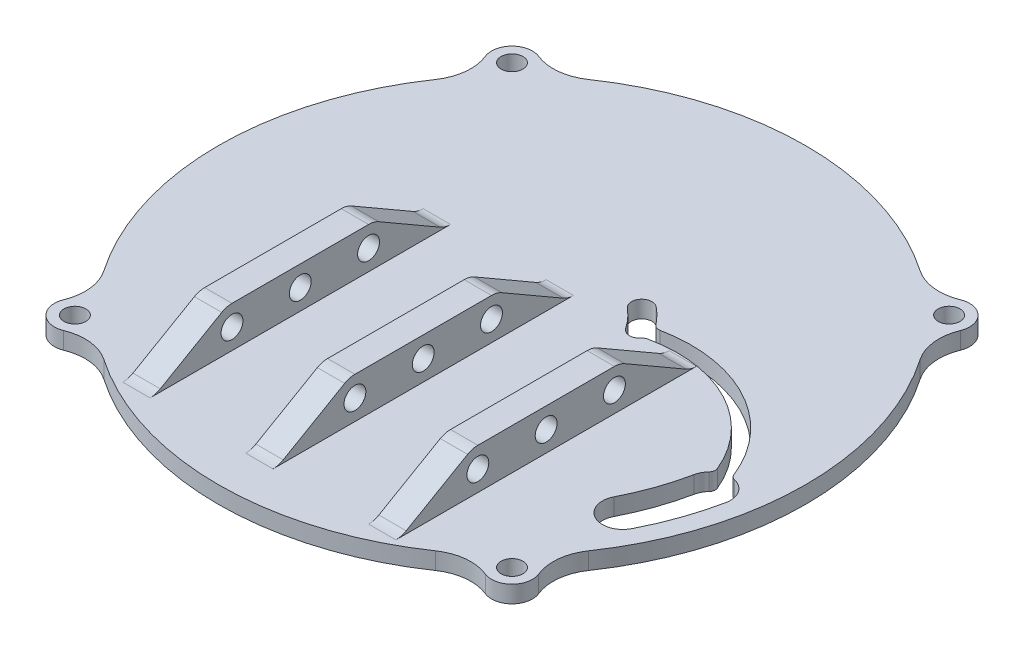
ISO-10303-21;
HEADER;
FILE_DESCRIPTION(('STEP AP214'),'2;1');
FILE_NAME('part.step','',(''),(''),'','','');
FILE_SCHEMA(('AUTOMOTIVE_DESIGN { 1 0 10303 214 1 1 1 1 }'));
ENDSEC;
DATA;
#1=APPLICATION_CONTEXT('core data for automotive mechanical design processes');
#2=APPLICATION_PROTOCOL_DEFINITION('international standard','automotive_design',2000,#1);
#3=PRODUCT_CONTEXT('',#1,'mechanical');
#4=PRODUCT('Part','Part','',(#3));
#5=PRODUCT_RELATED_PRODUCT_CATEGORY('part','',(#4));
#6=PRODUCT_DEFINITION_FORMATION('','',#4);
#7=PRODUCT_DEFINITION_CONTEXT('part definition',#1,'design');
#8=PRODUCT_DEFINITION('design','',#6,#7);
#9=PRODUCT_DEFINITION_SHAPE('','',#8);
#10=(LENGTH_UNIT() NAMED_UNIT(*) SI_UNIT(.MILLI.,.METRE.));
#11=(NAMED_UNIT(*) PLANE_ANGLE_UNIT() SI_UNIT($,.RADIAN.));
#12=(NAMED_UNIT(*) SI_UNIT($,.STERADIAN.) SOLID_ANGLE_UNIT());
#13=UNCERTAINTY_MEASURE_WITH_UNIT(LENGTH_MEASURE(1.E-05),#10,'distance_accuracy_value','');
#14=(GEOMETRIC_REPRESENTATION_CONTEXT(3) GLOBAL_UNCERTAINTY_ASSIGNED_CONTEXT((#13)) GLOBAL_UNIT_ASSIGNED_CONTEXT((#10,
#11,#12)) REPRESENTATION_CONTEXT('',''));
#15=CARTESIAN_POINT('',(0.,0.,0.));
#16=DIRECTION('',(0.,0.,1.));
#17=DIRECTION('',(1.,0.,0.));
#18=AXIS2_PLACEMENT_3D('',#15,#16,#17);
#19=CARTESIAN_POINT('',(-20.6322035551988,0.,-14.1177964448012));
#20=DIRECTION('',(0.,-1.,0.));
#21=DIRECTION('',(0.,0.,-1.));
#22=AXIS2_PLACEMENT_3D('',#19,#20,#21);
#23=PLANE('',#22);
#24=CARTESIAN_POINT('',(32.0000000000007,0.,32.));
#25=DIRECTION('',(0.,1.,0.));
#26=DIRECTION('',(0.,0.,1.));
#27=AXIS2_PLACEMENT_3D('',#24,#25,#26);
#28=CIRCLE('',#27,1.6);
#29=CARTESIAN_POINT('',(32.0000000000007,0.,33.6));
#30=VERTEX_POINT('',#29);
#31=EDGE_CURVE('E504',#30,#30,#28,.T.);
#32=ORIENTED_EDGE('',*,*,#31,.T.);
#33=EDGE_LOOP('',(#32));
#34=FACE_BOUND('',#33,.T.);
#35=CARTESIAN_POINT('',(-32.,0.,-32.));
#36=DIRECTION('',(0.,1.,0.));
#37=DIRECTION('',(0.,0.,1.));
#38=AXIS2_PLACEMENT_3D('',#35,#36,#37);
#39=CIRCLE('',#38,1.6);
#40=CARTESIAN_POINT('',(-32.,0.,-30.4));
#41=VERTEX_POINT('',#40);
#42=EDGE_CURVE('E510',#41,#41,#39,.T.);
#43=ORIENTED_EDGE('',*,*,#42,.T.);
#44=EDGE_LOOP('',(#43));
#45=FACE_BOUND('',#44,.T.);
#46=CARTESIAN_POINT('',(-41.2644071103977,0.,-28.2355928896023));
#47=DIRECTION('',(0.,-1.,0.));
#48=DIRECTION('',(0.,0.,-1.));
#49=AXIS2_PLACEMENT_3D('',#46,#47,#48);
#50=CIRCLE('',#49,7.);
#51=CARTESIAN_POINT('',(-34.7793221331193,0.,-30.8706778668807));
#52=VERTEX_POINT('',#51);
#53=CARTESIAN_POINT('',(-35.487390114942,0.,-24.282609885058));
#54=VERTEX_POINT('',#53);
#55=EDGE_CURVE('E513',#52,#54,#50,.T.);
#56=ORIENTED_EDGE('',*,*,#55,.F.);
#57=CARTESIAN_POINT('',(-32.,0.,-32.));
#58=DIRECTION('',(0.,1.,0.));
#59=DIRECTION('',(0.,0.,-1.));
#60=AXIS2_PLACEMENT_3D('',#57,#58,#59);
#61=CIRCLE('',#60,3.);
#62=CARTESIAN_POINT('',(-30.8706778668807,0.,-34.7793221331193));
#63=VERTEX_POINT('',#62);
#64=EDGE_CURVE('E558',#63,#52,#61,.T.);
#65=ORIENTED_EDGE('',*,*,#64,.F.);
#66=CARTESIAN_POINT('',(-28.2355928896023,0.,-41.2644071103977));
#67=DIRECTION('',(0.,-1.,0.));
#68=DIRECTION('',(0.,0.,1.));
#69=AXIS2_PLACEMENT_3D('',#66,#67,#68);
#70=CIRCLE('',#69,7.);
#71=CARTESIAN_POINT('',(-24.282609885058,0.,-35.487390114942));
#72=VERTEX_POINT('',#71);
#73=EDGE_CURVE('E555',#72,#63,#70,.T.);
#74=ORIENTED_EDGE('',*,*,#73,.F.);
#75=CARTESIAN_POINT('',(0.,0.,0.));
#76=DIRECTION('',(0.,1.,0.));
#77=DIRECTION('',(0.,0.,-1.));
#78=AXIS2_PLACEMENT_3D('',#75,#76,#77);
#79=CIRCLE('',#78,43.);
#80=CARTESIAN_POINT('',(24.282609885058,0.,-35.487390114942));
#81=VERTEX_POINT('',#80);
#82=EDGE_CURVE('E552',#81,#72,#79,.T.);
#83=ORIENTED_EDGE('',*,*,#82,.F.);
#84=CARTESIAN_POINT('',(28.2355928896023,0.,-41.2644071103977));
#85=DIRECTION('',(0.,-1.,0.));
#86=DIRECTION('',(0.,0.,-1.));
#87=AXIS2_PLACEMENT_3D('',#84,#85,#86);
#88=CIRCLE('',#87,7.);
#89=CARTESIAN_POINT('',(30.8706778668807,0.,-34.7793221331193));
#90=VERTEX_POINT('',#89);
#91=EDGE_CURVE('E549',#90,#81,#88,.T.);
#92=ORIENTED_EDGE('',*,*,#91,.F.);
#93=CARTESIAN_POINT('',(32.0000000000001,0.,-31.9999999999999));
#94=DIRECTION('',(0.,1.,0.));
#95=DIRECTION('',(0.,0.,-1.));
#96=AXIS2_PLACEMENT_3D('',#93,#94,#95);
#97=CIRCLE('',#96,3.);
#98=CARTESIAN_POINT('',(34.7793221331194,0.,-30.8706778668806));
#99=VERTEX_POINT('',#98);
#100=EDGE_CURVE('E546',#99,#90,#97,.T.);
#101=ORIENTED_EDGE('',*,*,#100,.F.);
#102=CARTESIAN_POINT('',(41.2644071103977,0.,-28.2355928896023));
#103=DIRECTION('',(0.,-1.,0.));
#104=DIRECTION('',(0.,0.,1.));
#105=AXIS2_PLACEMENT_3D('',#102,#103,#104);
#106=CIRCLE('',#105,7.);
#107=CARTESIAN_POINT('',(35.487390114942,0.,-24.282609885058));
#108=VERTEX_POINT('',#107);
#109=EDGE_CURVE('E543',#108,#99,#106,.T.);
#110=ORIENTED_EDGE('',*,*,#109,.F.);
#111=CARTESIAN_POINT('',(0.,0.,0.));
#112=DIRECTION('',(0.,1.,0.));
#113=DIRECTION('',(0.,0.,-1.));
#114=AXIS2_PLACEMENT_3D('',#111,#112,#113);
#115=CIRCLE('',#114,43.);
#116=CARTESIAN_POINT('',(35.487390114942,0.,24.282609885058));
#117=VERTEX_POINT('',#116);
#118=EDGE_CURVE('E540',#117,#108,#115,.T.);
#119=ORIENTED_EDGE('',*,*,#118,.F.);
#120=CARTESIAN_POINT('',(41.2644071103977,0.,28.2355928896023));
#121=DIRECTION('',(0.,-1.,0.));
#122=DIRECTION('',(0.,0.,-1.));
#123=AXIS2_PLACEMENT_3D('',#120,#121,#122);
#124=CIRCLE('',#123,7.);
#125=CARTESIAN_POINT('',(34.7793221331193,0.,30.8706778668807));
#126=VERTEX_POINT('',#125);
#127=EDGE_CURVE('E537',#126,#117,#124,.T.);
#128=ORIENTED_EDGE('',*,*,#127,.F.);
#129=CARTESIAN_POINT('',(31.9999999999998,0.,32.0000000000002));
#130=DIRECTION('',(0.,1.,0.));
#131=DIRECTION('',(0.,0.,-1.));
#132=AXIS2_PLACEMENT_3D('',#129,#130,#131);
#133=CIRCLE('',#132,3.);
#134=CARTESIAN_POINT('',(30.8706778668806,0.,34.7793221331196));
#135=VERTEX_POINT('',#134);
#136=EDGE_CURVE('E534',#135,#126,#133,.T.);
#137=ORIENTED_EDGE('',*,*,#136,.F.);
#138=CARTESIAN_POINT('',(28.2355928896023,0.,41.2644071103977));
#139=DIRECTION('',(0.,-1.,0.));
#140=DIRECTION('',(0.,0.,1.));
#141=AXIS2_PLACEMENT_3D('',#138,#139,#140);
#142=CIRCLE('',#141,7.);
#143=CARTESIAN_POINT('',(24.282609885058,0.,35.487390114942));
#144=VERTEX_POINT('',#143);
#145=EDGE_CURVE('E531',#144,#135,#142,.T.);
#146=ORIENTED_EDGE('',*,*,#145,.F.);
#147=CARTESIAN_POINT('',(0.,0.,0.));
#148=DIRECTION('',(0.,1.,0.));
#149=DIRECTION('',(0.,0.,-1.));
#150=AXIS2_PLACEMENT_3D('',#147,#148,#149);
#151=CIRCLE('',#150,43.);
#152=CARTESIAN_POINT('',(-24.282609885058,0.,35.487390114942));
#153=VERTEX_POINT('',#152);
#154=EDGE_CURVE('E528',#153,#144,#151,.T.);
#155=ORIENTED_EDGE('',*,*,#154,.F.);
#156=CARTESIAN_POINT('',(-28.2355928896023,0.,41.2644071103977));
#157=DIRECTION('',(0.,-1.,0.));
#158=DIRECTION('',(0.,0.,-1.));
#159=AXIS2_PLACEMENT_3D('',#156,#157,#158);
#160=CIRCLE('',#159,7.);
#161=CARTESIAN_POINT('',(-30.8706778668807,0.,34.7793221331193));
#162=VERTEX_POINT('',#161);
#163=EDGE_CURVE('E525',#162,#153,#160,.T.);
#164=ORIENTED_EDGE('',*,*,#163,.F.);
#165=CARTESIAN_POINT('',(-32.0000000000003,0.,31.9999999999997));
#166=DIRECTION('',(0.,1.,0.));
#167=DIRECTION('',(0.,0.,-1.));
#168=AXIS2_PLACEMENT_3D('',#165,#166,#167);
#169=CIRCLE('',#168,3.);
#170=CARTESIAN_POINT('',(-34.7793221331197,0.,30.8706778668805));
#171=VERTEX_POINT('',#170);
#172=EDGE_CURVE('E522',#171,#162,#169,.T.);
#173=ORIENTED_EDGE('',*,*,#172,.F.);
#174=CARTESIAN_POINT('',(-41.2644071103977,0.,28.2355928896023));
#175=DIRECTION('',(0.,-1.,0.));
#176=DIRECTION('',(0.,0.,1.));
#177=AXIS2_PLACEMENT_3D('',#174,#175,#176);
#178=CIRCLE('',#177,7.);
#179=CARTESIAN_POINT('',(-35.487390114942,0.,24.282609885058));
#180=VERTEX_POINT('',#179);
#181=EDGE_CURVE('E519',#180,#171,#178,.T.);
#182=ORIENTED_EDGE('',*,*,#181,.F.);
#183=CARTESIAN_POINT('',(0.,0.,0.));
#184=DIRECTION('',(0.,1.,0.));
#185=DIRECTION('',(0.,0.,-1.));
#186=AXIS2_PLACEMENT_3D('',#183,#184,#185);
#187=CIRCLE('',#186,43.);
#188=EDGE_CURVE('E516',#54,#180,#187,.T.);
#189=ORIENTED_EDGE('',*,*,#188,.F.);
#190=EDGE_LOOP('',(#56,#65,#74,#83,#92,#101,#110,#119,#128,#137,#146,#155,#164,#173,#182,#189));
#191=FACE_BOUND('',#190,.T.);
#192=CARTESIAN_POINT('',(32.,0.,-32.));
#193=DIRECTION('',(0.,1.,0.));
#194=DIRECTION('',(0.,0.,1.));
#195=AXIS2_PLACEMENT_3D('',#192,#193,#194);
#196=CIRCLE('',#195,1.6);
#197=CARTESIAN_POINT('',(32.,0.,-30.4));
#198=VERTEX_POINT('',#197);
#199=EDGE_CURVE('E507',#198,#198,#196,.T.);
#200=ORIENTED_EDGE('',*,*,#199,.T.);
#201=EDGE_LOOP('',(#200));
#202=FACE_BOUND('',#201,.T.);
#203=CARTESIAN_POINT('',(-31.9999999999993,0.,32.));
#204=DIRECTION('',(0.,1.,0.));
#205=DIRECTION('',(0.,0.,1.));
#206=AXIS2_PLACEMENT_3D('',#203,#204,#205);
#207=CIRCLE('',#206,1.6);
#208=CARTESIAN_POINT('',(-31.9999999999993,0.,33.6));
#209=VERTEX_POINT('',#208);
#210=EDGE_CURVE('E501',#209,#209,#207,.T.);
#211=ORIENTED_EDGE('',*,*,#210,.T.);
#212=EDGE_LOOP('',(#211));
#213=FACE_BOUND('',#212,.T.);
#214=CARTESIAN_POINT('',(11.2249721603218,0.,-7.5));
#215=DIRECTION('',(0.,1.,0.));
#216=DIRECTION('',(0.,0.,1.));
#217=AXIS2_PLACEMENT_3D('',#214,#215,#216);
#218=CIRCLE('',#217,1.5);
#219=CARTESIAN_POINT('',(9.97775303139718,0.,-6.66666666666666));
#220=VERTEX_POINT('',#219);
#221=CARTESIAN_POINT('',(12.3944418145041,0.,-6.56067006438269));
#222=VERTEX_POINT('',#221);
#223=EDGE_CURVE('E409',#220,#222,#218,.T.);
#224=ORIENTED_EDGE('',*,*,#223,.T.);
#225=CARTESIAN_POINT('',(13.1740882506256,0.,-5.93445010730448));
#226=DIRECTION('',(0.,-1.,0.));
#227=DIRECTION('',(0.,0.,-1.));
#228=AXIS2_PLACEMENT_3D('',#225,#226,#227);
#229=CIRCLE('',#228,1.);
#230=CARTESIAN_POINT('',(12.9656089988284,0.,-6.91247689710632));
#231=VERTEX_POINT('',#230);
#232=EDGE_CURVE('E752',#222,#231,#229,.T.);
#233=ORIENTED_EDGE('',*,*,#232,.T.);
#234=CARTESIAN_POINT('',(16.926714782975,0.,11.6700321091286));
#235=DIRECTION('',(0.,-1.,0.));
#236=DIRECTION('',(0.,0.,1.));
#237=AXIS2_PLACEMENT_3D('',#234,#235,#236);
#238=CIRCLE('',#237,19.);
#239=CARTESIAN_POINT('',(34.4791730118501,0.,4.39602288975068));
#240=VERTEX_POINT('',#239);
#241=EDGE_CURVE('E779',#231,#240,#238,.T.);
#242=ORIENTED_EDGE('',*,*,#241,.T.);
#243=CARTESIAN_POINT('',(33.5553594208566,0.,4.77886548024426));
#244=DIRECTION('',(0.,-1.,0.));
#245=DIRECTION('',(0.,0.,-1.));
#246=AXIS2_PLACEMENT_3D('',#243,#244,#245);
#247=CIRCLE('',#246,1.);
#248=CARTESIAN_POINT('',(34.2883083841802,0.,5.4591491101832));
#249=VERTEX_POINT('',#248);
#250=EDGE_CURVE('E56',#240,#249,#247,.T.);
#251=ORIENTED_EDGE('',*,*,#250,.T.);
#252=CARTESIAN_POINT('',(36.4871552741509,0.,7.5));
#253=DIRECTION('',(0.,1.,0.));
#254=DIRECTION('',(0.,0.,1.));
#255=AXIS2_PLACEMENT_3D('',#252,#253,#254);
#256=CIRCLE('',#255,3.);
#257=CARTESIAN_POINT('',(33.5485924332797,0.,6.89597315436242));
#258=VERTEX_POINT('',#257);
#259=EDGE_CURVE('E451',#249,#258,#256,.T.);
#260=ORIENTED_EDGE('',*,*,#259,.T.);
#261=CARTESIAN_POINT('',(0.,0.,0.));
#262=DIRECTION('',(0.,-1.,0.));
#263=DIRECTION('',(0.,0.,1.));
#264=AXIS2_PLACEMENT_3D('',#261,#262,#263);
#265=CIRCLE('',#264,34.25);
#266=CARTESIAN_POINT('',(30.5051737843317,0.,15.5723110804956));
#267=VERTEX_POINT('',#266);
#268=EDGE_CURVE('E428',#258,#267,#265,.T.);
#269=ORIENTED_EDGE('',*,*,#268,.T.);
#270=CARTESIAN_POINT('',(33.1771598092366,0.,16.9363091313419));
#271=DIRECTION('',(0.,1.,0.));
#272=DIRECTION('',(0.,0.,1.));
#273=AXIS2_PLACEMENT_3D('',#270,#271,#272);
#274=CIRCLE('',#273,3.);
#275=CARTESIAN_POINT('',(35.8491458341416,0.,18.3003071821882));
#276=VERTEX_POINT('',#275);
#277=EDGE_CURVE('E441',#267,#276,#274,.T.);
#278=ORIENTED_EDGE('',*,*,#277,.T.);
#279=CARTESIAN_POINT('',(0.,0.,0.));
#280=DIRECTION('',(0.,1.,0.));
#281=DIRECTION('',(0.,0.,1.));
#282=AXIS2_PLACEMENT_3D('',#279,#280,#281);
#283=CIRCLE('',#282,40.25);
#284=CARTESIAN_POINT('',(39.4257181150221,0.,8.10402684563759));
#285=VERTEX_POINT('',#284);
#286=EDGE_CURVE('E455',#276,#285,#283,.T.);
#287=ORIENTED_EDGE('',*,*,#286,.T.);
#288=CARTESIAN_POINT('',(37.1679305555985,0.,4.57826335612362));
#289=VERTEX_POINT('',#288);
#290=EDGE_CURVE('E452',#285,#289,#256,.T.);
#291=ORIENTED_EDGE('',*,*,#290,.T.);
#292=CARTESIAN_POINT('',(37.3948556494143,0.,3.60435114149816));
#293=DIRECTION('',(0.,-1.,0.));
#294=DIRECTION('',(0.,0.,-1.));
#295=AXIS2_PLACEMENT_3D('',#292,#293,#294);
#296=CIRCLE('',#295,1.);
#297=CARTESIAN_POINT('',(36.4644856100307,0.,3.97097300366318));
#298=VERTEX_POINT('',#297);
#299=EDGE_CURVE('E748',#289,#298,#296,.T.);
#300=ORIENTED_EDGE('',*,*,#299,.T.);
#301=CARTESIAN_POINT('',(16.926714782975,0.,11.6700321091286));
#302=DIRECTION('',(0.,1.,0.));
#303=DIRECTION('',(0.,0.,1.));
#304=AXIS2_PLACEMENT_3D('',#301,#302,#303);
#305=CIRCLE('',#304,21.);
#306=CARTESIAN_POINT('',(12.7712611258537,0.,-8.91472450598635));
#307=VERTEX_POINT('',#306);
#308=EDGE_CURVE('E784',#298,#307,#305,.T.);
#309=ORIENTED_EDGE('',*,*,#308,.T.);
#310=CARTESIAN_POINT('',(12.5733823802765,0.,-9.89495101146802));
#311=DIRECTION('',(0.,-1.,0.));
#312=DIRECTION('',(0.,0.,-1.));
#313=AXIS2_PLACEMENT_3D('',#310,#311,#312);
#314=CIRCLE('',#313,1.);
#315=CARTESIAN_POINT('',(11.7875459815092,0.,-9.27651657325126));
#316=VERTEX_POINT('',#315);
#317=EDGE_CURVE('E63',#307,#316,#314,.T.);
#318=ORIENTED_EDGE('',*,*,#317,.T.);
#319=CARTESIAN_POINT('',(0.,0.,0.));
#320=DIRECTION('',(0.,1.,0.));
#321=DIRECTION('',(0.,0.,1.));
#322=AXIS2_PLACEMENT_3D('',#319,#320,#321);
#323=CIRCLE('',#322,15.);
#324=CARTESIAN_POINT('',(9.48282579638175,0.,-11.6222207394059));
#325=VERTEX_POINT('',#324);
#326=EDGE_CURVE('E407',#316,#325,#323,.T.);
#327=ORIENTED_EDGE('',*,*,#326,.T.);
#328=CARTESIAN_POINT('',(8.53454321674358,0.,-10.4599986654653));
#329=DIRECTION('',(0.,1.,0.));
#330=DIRECTION('',(0.,0.,1.));
#331=AXIS2_PLACEMENT_3D('',#328,#329,#330);
#332=CIRCLE('',#331,1.5);
#333=CARTESIAN_POINT('',(7.5862606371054,0.,-9.29777659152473));
#334=VERTEX_POINT('',#333);
#335=EDGE_CURVE('E391',#325,#334,#332,.T.);
#336=ORIENTED_EDGE('',*,*,#335,.T.);
#337=CARTESIAN_POINT('',(0.,0.,0.));
#338=DIRECTION('',(0.,-1.,0.));
#339=DIRECTION('',(0.,0.,1.));
#340=AXIS2_PLACEMENT_3D('',#337,#338,#339);
#341=CIRCLE('',#340,12.);
#342=EDGE_CURVE('E402',#334,#220,#341,.T.);
#343=ORIENTED_EDGE('',*,*,#342,.T.);
#344=EDGE_LOOP('',(#224,#233,#242,#251,#260,#269,#278,#287,#291,#300,#309,#318,#327,#336,#343));
#345=FACE_BOUND('',#344,.T.);
#346=ADVANCED_FACE('F41',(#34,#45,#191,#202,#213,#345),#23,.T.);
#347=CARTESIAN_POINT('',(0.,2.5,0.));
#348=DIRECTION('',(0.,1.,0.));
#349=DIRECTION('',(0.,0.,1.));
#350=AXIS2_PLACEMENT_3D('',#347,#348,#349);
#351=PLANE('',#350);
#352=DIRECTION('',(0.,0.,-1.));
#353=VECTOR('',#352,1.);
#354=CARTESIAN_POINT('',(-20.,2.5,-6.19615242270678));
#355=LINE('',#354,#353);
#356=CARTESIAN_POINT('',(-20.,2.5,37.0000000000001));
#357=VERTEX_POINT('',#356);
#358=CARTESIAN_POINT('',(-20.,2.5,-7.00000000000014));
#359=VERTEX_POINT('',#358);
#360=EDGE_CURVE('E867',#357,#359,#355,.T.);
#361=ORIENTED_EDGE('',*,*,#360,.T.);
#362=DIRECTION('',(-1.,0.,0.));
#363=VECTOR('',#362,1.);
#364=CARTESIAN_POINT('',(0.,2.5,-7.00000000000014));
#365=LINE('',#364,#363);
#366=CARTESIAN_POINT('',(-16.,2.5,-7.00000000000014));
#367=VERTEX_POINT('',#366);
#368=EDGE_CURVE('E632',#359,#367,#365,.F.);
#369=ORIENTED_EDGE('',*,*,#368,.T.);
#370=DIRECTION('',(0.,0.,1.));
#371=VECTOR('',#370,1.);
#372=CARTESIAN_POINT('',(-16.,2.5,36.1961524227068));
#373=LINE('',#372,#371);
#374=CARTESIAN_POINT('',(-16.,2.5,37.0000000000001));
#375=VERTEX_POINT('',#374);
#376=EDGE_CURVE('E792',#367,#375,#373,.T.);
#377=ORIENTED_EDGE('',*,*,#376,.T.);
#378=DIRECTION('',(-1.,0.,0.));
#379=VECTOR('',#378,1.);
#380=CARTESIAN_POINT('',(0.,2.5,37.0000000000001));
#381=LINE('',#380,#379);
#382=EDGE_CURVE('E620',#375,#357,#381,.T.);
#383=ORIENTED_EDGE('',*,*,#382,.T.);
#384=EDGE_LOOP('',(#361,#369,#377,#383));
#385=FACE_BOUND('',#384,.T.);
#386=DIRECTION('',(0.,0.,-1.));
#387=VECTOR('',#386,1.);
#388=CARTESIAN_POINT('',(-2.,2.5,36.1961524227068));
#389=LINE('',#388,#387);
#390=CARTESIAN_POINT('',(-2.,2.5,37.0000000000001));
#391=VERTEX_POINT('',#390);
#392=CARTESIAN_POINT('',(-2.,2.5,-7.00000000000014));
#393=VERTEX_POINT('',#392);
#394=EDGE_CURVE('E600',#391,#393,#389,.T.);
#395=ORIENTED_EDGE('',*,*,#394,.T.);
#396=DIRECTION('',(-1.,0.,0.));
#397=VECTOR('',#396,1.);
#398=CARTESIAN_POINT('',(0.,2.5,-7.00000000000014));
#399=LINE('',#398,#397);
#400=CARTESIAN_POINT('',(2.,2.5,-7.00000000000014));
#401=VERTEX_POINT('',#400);
#402=EDGE_CURVE('E629',#393,#401,#399,.F.);
#403=ORIENTED_EDGE('',*,*,#402,.T.);
#404=DIRECTION('',(0.,0.,1.));
#405=VECTOR('',#404,1.);
#406=CARTESIAN_POINT('',(2.,2.5,36.1961524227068));
#407=LINE('',#406,#405);
#408=CARTESIAN_POINT('',(2.,2.5,37.0000000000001));
#409=VERTEX_POINT('',#408);
#410=EDGE_CURVE('E805',#401,#409,#407,.T.);
#411=ORIENTED_EDGE('',*,*,#410,.T.);
#412=DIRECTION('',(-1.,0.,0.));
#413=VECTOR('',#412,1.);
#414=CARTESIAN_POINT('',(0.,2.5,37.0000000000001));
#415=LINE('',#414,#413);
#416=EDGE_CURVE('E623',#409,#391,#415,.T.);
#417=ORIENTED_EDGE('',*,*,#416,.T.);
#418=EDGE_LOOP('',(#395,#403,#411,#417));
#419=FACE_BOUND('',#418,.T.);
#420=DIRECTION('',(0.,0.,-1.));
#421=VECTOR('',#420,1.);
#422=CARTESIAN_POINT('',(16.,2.5,36.1961524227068));
#423=LINE('',#422,#421);
#424=CARTESIAN_POINT('',(16.,2.5,37.0000000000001));
#425=VERTEX_POINT('',#424);
#426=CARTESIAN_POINT('',(16.,2.5,-7.00000000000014));
#427=VERTEX_POINT('',#426);
#428=EDGE_CURVE('E791',#425,#427,#423,.T.);
#429=ORIENTED_EDGE('',*,*,#428,.T.);
#430=DIRECTION('',(-1.,0.,0.));
#431=VECTOR('',#430,1.);
#432=CARTESIAN_POINT('',(0.,2.5,-7.00000000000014));
#433=LINE('',#432,#431);
#434=CARTESIAN_POINT('',(20.,2.5,-7.00000000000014));
#435=VERTEX_POINT('',#434);
#436=EDGE_CURVE('E635',#427,#435,#433,.F.);
#437=ORIENTED_EDGE('',*,*,#436,.T.);
#438=DIRECTION('',(0.,0.,-1.));
#439=VECTOR('',#438,1.);
#440=CARTESIAN_POINT('',(20.,2.5,-6.19615242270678));
#441=LINE('',#440,#439);
#442=CARTESIAN_POINT('',(20.,2.5,37.0000000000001));
#443=VERTEX_POINT('',#442);
#444=EDGE_CURVE('E870',#443,#435,#441,.T.);
#445=ORIENTED_EDGE('',*,*,#444,.F.);
#446=DIRECTION('',(-1.,0.,0.));
#447=VECTOR('',#446,1.);
#448=CARTESIAN_POINT('',(0.,2.5,37.0000000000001));
#449=LINE('',#448,#447);
#450=EDGE_CURVE('E626',#443,#425,#449,.T.);
#451=ORIENTED_EDGE('',*,*,#450,.T.);
#452=EDGE_LOOP('',(#429,#437,#445,#451));
#453=FACE_BOUND('',#452,.T.);
#454=CARTESIAN_POINT('',(-31.9999999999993,2.5,32.));
#455=DIRECTION('',(0.,1.,0.));
#456=DIRECTION('',(0.,0.,1.));
#457=AXIS2_PLACEMENT_3D('',#454,#455,#456);
#458=CIRCLE('',#457,1.6);
#459=CARTESIAN_POINT('',(-31.9999999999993,2.5,33.6));
#460=VERTEX_POINT('',#459);
#461=EDGE_CURVE('E422',#460,#460,#458,.T.);
#462=ORIENTED_EDGE('',*,*,#461,.F.);
#463=EDGE_LOOP('',(#462));
#464=FACE_BOUND('',#463,.T.);
#465=CARTESIAN_POINT('',(32.0000000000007,2.5,32.));
#466=DIRECTION('',(0.,1.,0.));
#467=DIRECTION('',(0.,0.,1.));
#468=AXIS2_PLACEMENT_3D('',#465,#466,#467);
#469=CIRCLE('',#468,1.6);
#470=CARTESIAN_POINT('',(32.0000000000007,2.5,33.6));
#471=VERTEX_POINT('',#470);
#472=EDGE_CURVE('E460',#471,#471,#469,.T.);
#473=ORIENTED_EDGE('',*,*,#472,.F.);
#474=EDGE_LOOP('',(#473));
#475=FACE_BOUND('',#474,.T.);
#476=CARTESIAN_POINT('',(32.,2.5,-32.));
#477=DIRECTION('',(0.,1.,0.));
#478=DIRECTION('',(0.,0.,1.));
#479=AXIS2_PLACEMENT_3D('',#476,#477,#478);
#480=CIRCLE('',#479,1.6);
#481=CARTESIAN_POINT('',(32.,2.5,-30.4));
#482=VERTEX_POINT('',#481);
#483=EDGE_CURVE('E463',#482,#482,#480,.T.);
#484=ORIENTED_EDGE('',*,*,#483,.F.);
#485=EDGE_LOOP('',(#484));
#486=FACE_BOUND('',#485,.T.);
#487=CARTESIAN_POINT('',(-32.,2.5,-32.));
#488=DIRECTION('',(0.,1.,0.));
#489=DIRECTION('',(0.,0.,1.));
#490=AXIS2_PLACEMENT_3D('',#487,#488,#489);
#491=CIRCLE('',#490,1.6);
#492=CARTESIAN_POINT('',(-32.,2.5,-30.4));
#493=VERTEX_POINT('',#492);
#494=EDGE_CURVE('E466',#493,#493,#491,.T.);
#495=ORIENTED_EDGE('',*,*,#494,.F.);
#496=EDGE_LOOP('',(#495));
#497=FACE_BOUND('',#496,.T.);
#498=CARTESIAN_POINT('',(-41.2644071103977,2.5,-28.2355928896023));
#499=DIRECTION('',(0.,1.,0.));
#500=DIRECTION('',(0.,0.,1.));
#501=AXIS2_PLACEMENT_3D('',#498,#499,#500);
#502=CIRCLE('',#501,7.);
#503=CARTESIAN_POINT('',(-34.7793221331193,2.5,-30.8706778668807));
#504=VERTEX_POINT('',#503);
#505=CARTESIAN_POINT('',(-35.487390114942,2.5,-24.282609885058));
#506=VERTEX_POINT('',#505);
#507=EDGE_CURVE('E499',#504,#506,#502,.F.);
#508=ORIENTED_EDGE('',*,*,#507,.T.);
#509=CARTESIAN_POINT('',(0.,2.5,0.));
#510=DIRECTION('',(0.,1.,0.));
#511=DIRECTION('',(0.,0.,1.));
#512=AXIS2_PLACEMENT_3D('',#509,#510,#511);
#513=CIRCLE('',#512,43.);
#514=CARTESIAN_POINT('',(-35.487390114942,2.5,24.282609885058));
#515=VERTEX_POINT('',#514);
#516=EDGE_CURVE('E497',#506,#515,#513,.T.);
#517=ORIENTED_EDGE('',*,*,#516,.T.);
#518=CARTESIAN_POINT('',(-41.2644071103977,2.5,28.2355928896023));
#519=DIRECTION('',(0.,1.,0.));
#520=DIRECTION('',(0.,0.,1.));
#521=AXIS2_PLACEMENT_3D('',#518,#519,#520);
#522=CIRCLE('',#521,7.);
#523=CARTESIAN_POINT('',(-34.7793221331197,2.5,30.8706778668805));
#524=VERTEX_POINT('',#523);
#525=EDGE_CURVE('E495',#515,#524,#522,.F.);
#526=ORIENTED_EDGE('',*,*,#525,.T.);
#527=CARTESIAN_POINT('',(-32.0000000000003,2.5,31.9999999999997));
#528=DIRECTION('',(0.,1.,0.));
#529=DIRECTION('',(0.,0.,1.));
#530=AXIS2_PLACEMENT_3D('',#527,#528,#529);
#531=CIRCLE('',#530,3.);
#532=CARTESIAN_POINT('',(-30.8706778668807,2.5,34.7793221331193));
#533=VERTEX_POINT('',#532);
#534=EDGE_CURVE('E493',#524,#533,#531,.T.);
#535=ORIENTED_EDGE('',*,*,#534,.T.);
#536=CARTESIAN_POINT('',(-28.2355928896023,2.5,41.2644071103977));
#537=DIRECTION('',(0.,1.,0.));
#538=DIRECTION('',(0.,0.,1.));
#539=AXIS2_PLACEMENT_3D('',#536,#537,#538);
#540=CIRCLE('',#539,7.);
#541=CARTESIAN_POINT('',(-24.282609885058,2.5,35.487390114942));
#542=VERTEX_POINT('',#541);
#543=EDGE_CURVE('E491',#533,#542,#540,.F.);
#544=ORIENTED_EDGE('',*,*,#543,.T.);
#545=CARTESIAN_POINT('',(0.,2.5,0.));
#546=DIRECTION('',(0.,1.,0.));
#547=DIRECTION('',(0.,0.,1.));
#548=AXIS2_PLACEMENT_3D('',#545,#546,#547);
#549=CIRCLE('',#548,43.);
#550=CARTESIAN_POINT('',(24.282609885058,2.5,35.487390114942));
#551=VERTEX_POINT('',#550);
#552=EDGE_CURVE('E489',#542,#551,#549,.T.);
#553=ORIENTED_EDGE('',*,*,#552,.T.);
#554=CARTESIAN_POINT('',(28.2355928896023,2.5,41.2644071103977));
#555=DIRECTION('',(0.,1.,0.));
#556=DIRECTION('',(0.,0.,1.));
#557=AXIS2_PLACEMENT_3D('',#554,#555,#556);
#558=CIRCLE('',#557,7.);
#559=CARTESIAN_POINT('',(30.8706778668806,2.5,34.7793221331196));
#560=VERTEX_POINT('',#559);
#561=EDGE_CURVE('E487',#551,#560,#558,.F.);
#562=ORIENTED_EDGE('',*,*,#561,.T.);
#563=CARTESIAN_POINT('',(31.9999999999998,2.5,32.0000000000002));
#564=DIRECTION('',(0.,1.,0.));
#565=DIRECTION('',(0.,0.,1.));
#566=AXIS2_PLACEMENT_3D('',#563,#564,#565);
#567=CIRCLE('',#566,3.);
#568=CARTESIAN_POINT('',(34.7793221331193,2.5,30.8706778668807));
#569=VERTEX_POINT('',#568);
#570=EDGE_CURVE('E485',#560,#569,#567,.T.);
#571=ORIENTED_EDGE('',*,*,#570,.T.);
#572=CARTESIAN_POINT('',(41.2644071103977,2.5,28.2355928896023));
#573=DIRECTION('',(0.,1.,0.));
#574=DIRECTION('',(0.,0.,1.));
#575=AXIS2_PLACEMENT_3D('',#572,#573,#574);
#576=CIRCLE('',#575,7.);
#577=CARTESIAN_POINT('',(35.487390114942,2.5,24.282609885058));
#578=VERTEX_POINT('',#577);
#579=EDGE_CURVE('E483',#569,#578,#576,.F.);
#580=ORIENTED_EDGE('',*,*,#579,.T.);
#581=CARTESIAN_POINT('',(0.,2.5,0.));
#582=DIRECTION('',(0.,1.,0.));
#583=DIRECTION('',(0.,0.,1.));
#584=AXIS2_PLACEMENT_3D('',#581,#582,#583);
#585=CIRCLE('',#584,43.);
#586=CARTESIAN_POINT('',(35.487390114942,2.5,-24.282609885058));
#587=VERTEX_POINT('',#586);
#588=EDGE_CURVE('E481',#578,#587,#585,.T.);
#589=ORIENTED_EDGE('',*,*,#588,.T.);
#590=CARTESIAN_POINT('',(41.2644071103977,2.5,-28.2355928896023));
#591=DIRECTION('',(0.,1.,0.));
#592=DIRECTION('',(0.,0.,1.));
#593=AXIS2_PLACEMENT_3D('',#590,#591,#592);
#594=CIRCLE('',#593,7.);
#595=CARTESIAN_POINT('',(34.7793221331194,2.5,-30.8706778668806));
#596=VERTEX_POINT('',#595);
#597=EDGE_CURVE('E479',#587,#596,#594,.F.);
#598=ORIENTED_EDGE('',*,*,#597,.T.);
#599=CARTESIAN_POINT('',(32.0000000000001,2.5,-31.9999999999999));
#600=DIRECTION('',(0.,1.,0.));
#601=DIRECTION('',(0.,0.,1.));
#602=AXIS2_PLACEMENT_3D('',#599,#600,#601);
#603=CIRCLE('',#602,3.);
#604=CARTESIAN_POINT('',(30.8706778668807,2.5,-34.7793221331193));
#605=VERTEX_POINT('',#604);
#606=EDGE_CURVE('E477',#596,#605,#603,.T.);
#607=ORIENTED_EDGE('',*,*,#606,.T.);
#608=CARTESIAN_POINT('',(28.2355928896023,2.5,-41.2644071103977));
#609=DIRECTION('',(0.,1.,0.));
#610=DIRECTION('',(0.,0.,1.));
#611=AXIS2_PLACEMENT_3D('',#608,#609,#610);
#612=CIRCLE('',#611,7.);
#613=CARTESIAN_POINT('',(24.282609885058,2.5,-35.487390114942));
#614=VERTEX_POINT('',#613);
#615=EDGE_CURVE('E475',#605,#614,#612,.F.);
#616=ORIENTED_EDGE('',*,*,#615,.T.);
#617=CARTESIAN_POINT('',(0.,2.5,0.));
#618=DIRECTION('',(0.,1.,0.));
#619=DIRECTION('',(0.,0.,1.));
#620=AXIS2_PLACEMENT_3D('',#617,#618,#619);
#621=CIRCLE('',#620,43.);
#622=CARTESIAN_POINT('',(-24.282609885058,2.5,-35.487390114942));
#623=VERTEX_POINT('',#622);
#624=EDGE_CURVE('E473',#614,#623,#621,.T.);
#625=ORIENTED_EDGE('',*,*,#624,.T.);
#626=CARTESIAN_POINT('',(-28.2355928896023,2.5,-41.2644071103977));
#627=DIRECTION('',(0.,1.,0.));
#628=DIRECTION('',(0.,0.,1.));
#629=AXIS2_PLACEMENT_3D('',#626,#627,#628);
#630=CIRCLE('',#629,7.);
#631=CARTESIAN_POINT('',(-30.8706778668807,2.5,-34.7793221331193));
#632=VERTEX_POINT('',#631);
#633=EDGE_CURVE('E471',#623,#632,#630,.F.);
#634=ORIENTED_EDGE('',*,*,#633,.T.);
#635=CARTESIAN_POINT('',(-32.,2.5,-32.));
#636=DIRECTION('',(0.,1.,0.));
#637=DIRECTION('',(0.,0.,1.));
#638=AXIS2_PLACEMENT_3D('',#635,#636,#637);
#639=CIRCLE('',#638,3.);
#640=EDGE_CURVE('E469',#632,#504,#639,.T.);
#641=ORIENTED_EDGE('',*,*,#640,.T.);
#642=EDGE_LOOP('',(#508,#517,#526,#535,#544,#553,#562,#571,#580,#589,#598,#607,#616,#625,#634,#641));
#643=FACE_BOUND('',#642,.T.);
#644=CARTESIAN_POINT('',(16.926714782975,2.5,11.6700321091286));
#645=DIRECTION('',(0.,1.,0.));
#646=DIRECTION('',(0.,0.,1.));
#647=AXIS2_PLACEMENT_3D('',#644,#645,#646);
#648=CIRCLE('',#647,19.);
#649=CARTESIAN_POINT('',(34.4791730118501,2.5,4.39602288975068));
#650=VERTEX_POINT('',#649);
#651=CARTESIAN_POINT('',(12.9656089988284,2.5,-6.91247689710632));
#652=VERTEX_POINT('',#651);
#653=EDGE_CURVE('E781',#650,#652,#648,.T.);
#654=ORIENTED_EDGE('',*,*,#653,.T.);
#655=CARTESIAN_POINT('',(13.1740882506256,2.5,-5.93445010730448));
#656=DIRECTION('',(0.,1.,0.));
#657=DIRECTION('',(0.,0.,1.));
#658=AXIS2_PLACEMENT_3D('',#655,#656,#657);
#659=CIRCLE('',#658,1.);
#660=CARTESIAN_POINT('',(12.3944418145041,2.5,-6.56067006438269));
#661=VERTEX_POINT('',#660);
#662=EDGE_CURVE('E744',#652,#661,#659,.T.);
#663=ORIENTED_EDGE('',*,*,#662,.T.);
#664=CARTESIAN_POINT('',(11.2249721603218,2.5,-7.5));
#665=DIRECTION('',(0.,1.,0.));
#666=DIRECTION('',(0.,0.,1.));
#667=AXIS2_PLACEMENT_3D('',#664,#665,#666);
#668=CIRCLE('',#667,1.5);
#669=CARTESIAN_POINT('',(9.97775303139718,2.5,-6.66666666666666));
#670=VERTEX_POINT('',#669);
#671=EDGE_CURVE('E413',#670,#661,#668,.T.);
#672=ORIENTED_EDGE('',*,*,#671,.F.);
#673=CARTESIAN_POINT('',(0.,2.5,0.));
#674=DIRECTION('',(0.,-1.,0.));
#675=DIRECTION('',(0.,0.,1.));
#676=AXIS2_PLACEMENT_3D('',#673,#674,#675);
#677=CIRCLE('',#676,12.);
#678=CARTESIAN_POINT('',(7.5862606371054,2.5,-9.29777659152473));
#679=VERTEX_POINT('',#678);
#680=EDGE_CURVE('E420',#679,#670,#677,.T.);
#681=ORIENTED_EDGE('',*,*,#680,.F.);
#682=CARTESIAN_POINT('',(8.53454321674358,2.5,-10.4599986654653));
#683=DIRECTION('',(0.,1.,0.));
#684=DIRECTION('',(0.,0.,1.));
#685=AXIS2_PLACEMENT_3D('',#682,#683,#684);
#686=CIRCLE('',#685,1.5);
#687=CARTESIAN_POINT('',(9.48282579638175,2.5,-11.6222207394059));
#688=VERTEX_POINT('',#687);
#689=EDGE_CURVE('E394',#688,#679,#686,.T.);
#690=ORIENTED_EDGE('',*,*,#689,.F.);
#691=CARTESIAN_POINT('',(0.,2.5,0.));
#692=DIRECTION('',(0.,1.,0.));
#693=DIRECTION('',(0.,0.,1.));
#694=AXIS2_PLACEMENT_3D('',#691,#692,#693);
#695=CIRCLE('',#694,15.);
#696=CARTESIAN_POINT('',(11.7875459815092,2.5,-9.27651657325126));
#697=VERTEX_POINT('',#696);
#698=EDGE_CURVE('E416',#697,#688,#695,.T.);
#699=ORIENTED_EDGE('',*,*,#698,.F.);
#700=CARTESIAN_POINT('',(12.5733823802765,2.5,-9.89495101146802));
#701=DIRECTION('',(0.,1.,0.));
#702=DIRECTION('',(0.,0.,1.));
#703=AXIS2_PLACEMENT_3D('',#700,#701,#702);
#704=CIRCLE('',#703,1.);
#705=CARTESIAN_POINT('',(12.7712611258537,2.5,-8.91472450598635));
#706=VERTEX_POINT('',#705);
#707=EDGE_CURVE('E742',#697,#706,#704,.T.);
#708=ORIENTED_EDGE('',*,*,#707,.T.);
#709=CARTESIAN_POINT('',(16.926714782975,2.5,11.6700321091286));
#710=DIRECTION('',(0.,1.,0.));
#711=DIRECTION('',(0.,0.,1.));
#712=AXIS2_PLACEMENT_3D('',#709,#710,#711);
#713=CIRCLE('',#712,21.);
#714=CARTESIAN_POINT('',(36.4644856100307,2.5,3.97097300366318));
#715=VERTEX_POINT('',#714);
#716=EDGE_CURVE('E783',#706,#715,#713,.F.);
#717=ORIENTED_EDGE('',*,*,#716,.T.);
#718=CARTESIAN_POINT('',(37.3948556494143,2.5,3.60435114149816));
#719=DIRECTION('',(0.,1.,0.));
#720=DIRECTION('',(0.,0.,1.));
#721=AXIS2_PLACEMENT_3D('',#718,#719,#720);
#722=CIRCLE('',#721,1.);
#723=CARTESIAN_POINT('',(37.1679305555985,2.5,4.57826335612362));
#724=VERTEX_POINT('',#723);
#725=EDGE_CURVE('E738',#715,#724,#722,.T.);
#726=ORIENTED_EDGE('',*,*,#725,.T.);
#727=CARTESIAN_POINT('',(36.4871552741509,2.5,7.5));
#728=DIRECTION('',(0.,1.,0.));
#729=DIRECTION('',(0.,0.,1.));
#730=AXIS2_PLACEMENT_3D('',#727,#728,#729);
#731=CIRCLE('',#730,3.);
#732=CARTESIAN_POINT('',(39.4257181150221,2.5,8.10402684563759));
#733=VERTEX_POINT('',#732);
#734=EDGE_CURVE('E442',#733,#724,#731,.T.);
#735=ORIENTED_EDGE('',*,*,#734,.F.);
#736=CARTESIAN_POINT('',(0.,2.5,0.));
#737=DIRECTION('',(0.,1.,0.));
#738=DIRECTION('',(0.,0.,1.));
#739=AXIS2_PLACEMENT_3D('',#736,#737,#738);
#740=CIRCLE('',#739,40.25);
#741=CARTESIAN_POINT('',(35.8491458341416,2.5,18.3003071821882));
#742=VERTEX_POINT('',#741);
#743=EDGE_CURVE('E445',#742,#733,#740,.T.);
#744=ORIENTED_EDGE('',*,*,#743,.F.);
#745=CARTESIAN_POINT('',(33.1771598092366,2.5,16.9363091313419));
#746=DIRECTION('',(0.,1.,0.));
#747=DIRECTION('',(0.,0.,1.));
#748=AXIS2_PLACEMENT_3D('',#745,#746,#747);
#749=CIRCLE('',#748,3.);
#750=CARTESIAN_POINT('',(30.5051737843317,2.5,15.5723110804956));
#751=VERTEX_POINT('',#750);
#752=EDGE_CURVE('E417',#751,#742,#749,.T.);
#753=ORIENTED_EDGE('',*,*,#752,.F.);
#754=CARTESIAN_POINT('',(0.,2.5,0.));
#755=DIRECTION('',(0.,-1.,0.));
#756=DIRECTION('',(0.,0.,1.));
#757=AXIS2_PLACEMENT_3D('',#754,#755,#756);
#758=CIRCLE('',#757,34.25);
#759=CARTESIAN_POINT('',(33.5485924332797,2.5,6.89597315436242));
#760=VERTEX_POINT('',#759);
#761=EDGE_CURVE('E437',#760,#751,#758,.T.);
#762=ORIENTED_EDGE('',*,*,#761,.F.);
#763=CARTESIAN_POINT('',(34.2883083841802,2.5,5.4591491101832));
#764=VERTEX_POINT('',#763);
#765=EDGE_CURVE('E440',#764,#760,#731,.T.);
#766=ORIENTED_EDGE('',*,*,#765,.F.);
#767=CARTESIAN_POINT('',(33.5553594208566,2.5,4.77886548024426));
#768=DIRECTION('',(0.,1.,0.));
#769=DIRECTION('',(0.,0.,1.));
#770=AXIS2_PLACEMENT_3D('',#767,#768,#769);
#771=CIRCLE('',#770,1.);
#772=EDGE_CURVE('E740',#764,#650,#771,.T.);
#773=ORIENTED_EDGE('',*,*,#772,.T.);
#774=EDGE_LOOP('',(#654,#663,#672,#681,#690,#699,#708,#717,#726,#735,#744,#753,#762,#766,#773));
#775=FACE_BOUND('',#774,.T.);
#776=ADVANCED_FACE('F771',(#385,#419,#453,#464,#475,#486,#497,#643,#775),#351,.T.);
#777=CARTESIAN_POINT('',(36.4871552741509,0.,7.5));
#778=DIRECTION('',(0.,1.,0.));
#779=DIRECTION('',(0.,0.,1.));
#780=AXIS2_PLACEMENT_3D('',#777,#778,#779);
#781=CYLINDRICAL_SURFACE('',#780,3.);
#782=ORIENTED_EDGE('',*,*,#734,.T.);
#783=DIRECTION('',(0.,1.,0.));
#784=VECTOR('',#783,1.);
#785=CARTESIAN_POINT('',(37.1679305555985,0.,4.57826335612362));
#786=LINE('',#785,#784);
#787=EDGE_CURVE('E11',#724,#289,#786,.F.);
#788=ORIENTED_EDGE('',*,*,#787,.T.);
#789=ORIENTED_EDGE('',*,*,#290,.F.);
#790=DIRECTION('',(0.,1.,0.));
#791=VECTOR('',#790,1.);
#792=CARTESIAN_POINT('',(39.4257181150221,0.,8.10402684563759));
#793=LINE('',#792,#791);
#794=EDGE_CURVE('E429',#285,#733,#793,.T.);
#795=ORIENTED_EDGE('',*,*,#794,.T.);
#796=EDGE_LOOP('',(#782,#788,#789,#795));
#797=FACE_BOUND('',#796,.T.);
#798=ADVANCED_FACE('F913',(#797),#781,.F.);
#799=ORIENTED_EDGE('',*,*,#259,.F.);
#800=DIRECTION('',(0.,1.,0.));
#801=VECTOR('',#800,1.);
#802=CARTESIAN_POINT('',(34.2883083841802,0.,5.45914911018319));
#803=LINE('',#802,#801);
#804=EDGE_CURVE('E49',#249,#764,#803,.T.);
#805=ORIENTED_EDGE('',*,*,#804,.T.);
#806=ORIENTED_EDGE('',*,*,#765,.T.);
#807=DIRECTION('',(0.,1.,0.));
#808=VECTOR('',#807,1.);
#809=CARTESIAN_POINT('',(33.5485924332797,0.,6.89597315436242));
#810=LINE('',#809,#808);
#811=EDGE_CURVE('E431',#258,#760,#810,.T.);
#812=ORIENTED_EDGE('',*,*,#811,.F.);
#813=EDGE_LOOP('',(#799,#805,#806,#812));
#814=FACE_BOUND('',#813,.T.);
#815=ADVANCED_FACE('F764',(#814),#781,.F.);
#816=CARTESIAN_POINT('',(11.2249721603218,0.,-7.5));
#817=DIRECTION('',(0.,1.,0.));
#818=DIRECTION('',(0.,0.,1.));
#819=AXIS2_PLACEMENT_3D('',#816,#817,#818);
#820=CYLINDRICAL_SURFACE('',#819,1.5);
#821=ORIENTED_EDGE('',*,*,#671,.T.);
#822=DIRECTION('',(0.,1.,0.));
#823=VECTOR('',#822,1.);
#824=CARTESIAN_POINT('',(12.3944418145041,0.,-6.56067006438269));
#825=LINE('',#824,#823);
#826=EDGE_CURVE('E746',#661,#222,#825,.F.);
#827=ORIENTED_EDGE('',*,*,#826,.T.);
#828=ORIENTED_EDGE('',*,*,#223,.F.);
#829=DIRECTION('',(0.,1.,0.));
#830=VECTOR('',#829,1.);
#831=CARTESIAN_POINT('',(9.97775303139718,0.,-6.66666666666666));
#832=LINE('',#831,#830);
#833=EDGE_CURVE('E398',#220,#670,#832,.T.);
#834=ORIENTED_EDGE('',*,*,#833,.T.);
#835=EDGE_LOOP('',(#821,#827,#828,#834));
#836=FACE_BOUND('',#835,.T.);
#837=ADVANCED_FACE('F894',(#836),#820,.F.);
#838=CARTESIAN_POINT('',(0.,0.,0.));
#839=DIRECTION('',(0.,1.,0.));
#840=DIRECTION('',(0.,0.,1.));
#841=AXIS2_PLACEMENT_3D('',#838,#839,#840);
#842=CYLINDRICAL_SURFACE('',#841,15.);
#843=ORIENTED_EDGE('',*,*,#326,.F.);
#844=DIRECTION('',(0.,1.,0.));
#845=VECTOR('',#844,1.);
#846=CARTESIAN_POINT('',(11.7875459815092,0.,-9.27651657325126));
#847=LINE('',#846,#845);
#848=EDGE_CURVE('E760',#316,#697,#847,.T.);
#849=ORIENTED_EDGE('',*,*,#848,.T.);
#850=ORIENTED_EDGE('',*,*,#698,.T.);
#851=DIRECTION('',(0.,1.,0.));
#852=VECTOR('',#851,1.);
#853=CARTESIAN_POINT('',(9.48282579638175,0.,-11.6222207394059));
#854=LINE('',#853,#852);
#855=EDGE_CURVE('E399',#325,#688,#854,.T.);
#856=ORIENTED_EDGE('',*,*,#855,.F.);
#857=EDGE_LOOP('',(#843,#849,#850,#856));
#858=FACE_BOUND('',#857,.T.);
#859=ADVANCED_FACE('F1139',(#858),#842,.F.);
#860=CARTESIAN_POINT('',(20.,8.5,4.19615242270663));
#861=DIRECTION('',(0.,-0.866025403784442,0.499999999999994));
#862=DIRECTION('',(0.,-0.499999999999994,-0.866025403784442));
#863=AXIS2_PLACEMENT_3D('',#860,#861,#862);
#864=PLANE('',#863);
#865=DIRECTION('',(0.,-0.499999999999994,-0.866025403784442));
#866=VECTOR('',#865,1.);
#867=CARTESIAN_POINT('',(-16.,8.49999999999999,4.19615242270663));
#868=LINE('',#867,#866);
#869=CARTESIAN_POINT('',(-16.,8.09807621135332,3.5));
#870=VERTEX_POINT('',#869);
#871=CARTESIAN_POINT('',(-16.,2.90192378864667,-5.50000000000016));
#872=VERTEX_POINT('',#871);
#873=EDGE_CURVE('E848',#870,#872,#868,.T.);
#874=ORIENTED_EDGE('',*,*,#873,.T.);
#875=DIRECTION('',(-1.,0.,0.));
#876=VECTOR('',#875,1.);
#877=CARTESIAN_POINT('',(20.,2.90192378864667,-5.50000000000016));
#878=LINE('',#877,#876);
#879=CARTESIAN_POINT('',(-20.,2.90192378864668,-5.50000000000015));
#880=VERTEX_POINT('',#879);
#881=EDGE_CURVE('E640',#872,#880,#878,.T.);
#882=ORIENTED_EDGE('',*,*,#881,.T.);
#883=DIRECTION('',(0.,0.499999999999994,0.866025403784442));
#884=VECTOR('',#883,1.);
#885=CARTESIAN_POINT('',(-20.,8.5,4.19615242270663));
#886=LINE('',#885,#884);
#887=CARTESIAN_POINT('',(-20.,8.09807621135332,3.5));
#888=VERTEX_POINT('',#887);
#889=EDGE_CURVE('E882',#880,#888,#886,.T.);
#890=ORIENTED_EDGE('',*,*,#889,.T.);
#891=DIRECTION('',(-1.,0.,0.));
#892=VECTOR('',#891,1.);
#893=CARTESIAN_POINT('',(20.,8.09807621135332,3.5));
#894=LINE('',#893,#892);
#895=EDGE_CURVE('E638',#888,#870,#894,.F.);
#896=ORIENTED_EDGE('',*,*,#895,.T.);
#897=EDGE_LOOP('',(#874,#882,#890,#896));
#898=FACE_BOUND('',#897,.T.);
#899=ADVANCED_FACE('F1147',(#898),#864,.F.);
#900=DIRECTION('',(0.,-0.499999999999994,-0.866025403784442));
#901=VECTOR('',#900,1.);
#902=CARTESIAN_POINT('',(2.,8.5,4.19615242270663));
#903=LINE('',#902,#901);
#904=CARTESIAN_POINT('',(2.,8.09807621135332,3.5));
#905=VERTEX_POINT('',#904);
#906=CARTESIAN_POINT('',(2.,2.90192378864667,-5.50000000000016));
#907=VERTEX_POINT('',#906);
#908=EDGE_CURVE('E610',#905,#907,#903,.T.);
#909=ORIENTED_EDGE('',*,*,#908,.T.);
#910=DIRECTION('',(-1.,0.,0.));
#911=VECTOR('',#910,1.);
#912=CARTESIAN_POINT('',(20.,2.90192378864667,-5.50000000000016));
#913=LINE('',#912,#911);
#914=CARTESIAN_POINT('',(-2.,2.90192378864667,-5.50000000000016));
#915=VERTEX_POINT('',#914);
#916=EDGE_CURVE('E645',#907,#915,#913,.T.);
#917=ORIENTED_EDGE('',*,*,#916,.T.);
#918=DIRECTION('',(0.,0.499999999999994,0.866025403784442));
#919=VECTOR('',#918,1.);
#920=CARTESIAN_POINT('',(-2.,8.5,4.19615242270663));
#921=LINE('',#920,#919);
#922=CARTESIAN_POINT('',(-2.,8.09807621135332,3.5));
#923=VERTEX_POINT('',#922);
#924=EDGE_CURVE('E615',#915,#923,#921,.T.);
#925=ORIENTED_EDGE('',*,*,#924,.T.);
#926=DIRECTION('',(-1.,0.,0.));
#927=VECTOR('',#926,1.);
#928=CARTESIAN_POINT('',(20.,8.09807621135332,3.5));
#929=LINE('',#928,#927);
#930=EDGE_CURVE('E643',#923,#905,#929,.F.);
#931=ORIENTED_EDGE('',*,*,#930,.T.);
#932=EDGE_LOOP('',(#909,#917,#925,#931));
#933=FACE_BOUND('',#932,.T.);
#934=ADVANCED_FACE('F1255',(#933),#864,.F.);
#935=CARTESIAN_POINT('',(20.,8.5,25.8038475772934));
#936=DIRECTION('',(0.,-1.,0.));
#937=DIRECTION('',(0.,0.,-1.));
#938=AXIS2_PLACEMENT_3D('',#935,#936,#937);
#939=PLANE('',#938);
#940=DIRECTION('',(0.,0.,1.));
#941=VECTOR('',#940,1.);
#942=CARTESIAN_POINT('',(-20.,8.5,25.8038475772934));
#943=LINE('',#942,#941);
#944=CARTESIAN_POINT('',(-20.,8.5,4.99999999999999));
#945=VERTEX_POINT('',#944);
#946=CARTESIAN_POINT('',(-20.,8.5,25.));
#947=VERTEX_POINT('',#946);
#948=EDGE_CURVE('E885',#945,#947,#943,.T.);
#949=ORIENTED_EDGE('',*,*,#948,.T.);
#950=DIRECTION('',(-1.,0.,0.));
#951=VECTOR('',#950,1.);
#952=CARTESIAN_POINT('',(20.,8.5,25.));
#953=LINE('',#952,#951);
#954=CARTESIAN_POINT('',(-16.,8.5,25.));
#955=VERTEX_POINT('',#954);
#956=EDGE_CURVE('E670',#947,#955,#953,.F.);
#957=ORIENTED_EDGE('',*,*,#956,.T.);
#958=DIRECTION('',(0.,0.,1.));
#959=VECTOR('',#958,1.);
#960=CARTESIAN_POINT('',(-16.,8.5,36.1961524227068));
#961=LINE('',#960,#959);
#962=CARTESIAN_POINT('',(-16.,8.5,4.99999999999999));
#963=VERTEX_POINT('',#962);
#964=EDGE_CURVE('E796',#963,#955,#961,.T.);
#965=ORIENTED_EDGE('',*,*,#964,.F.);
#966=DIRECTION('',(-1.,0.,0.));
#967=VECTOR('',#966,1.);
#968=CARTESIAN_POINT('',(20.,8.5,4.99999999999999));
#969=LINE('',#968,#967);
#970=EDGE_CURVE('E667',#963,#945,#969,.T.);
#971=ORIENTED_EDGE('',*,*,#970,.T.);
#972=EDGE_LOOP('',(#949,#957,#965,#971));
#973=FACE_BOUND('',#972,.T.);
#974=ADVANCED_FACE('F1265',(#973),#939,.F.);
#975=DIRECTION('',(0.,0.,-1.));
#976=VECTOR('',#975,1.);
#977=CARTESIAN_POINT('',(-2.,8.5,36.1961524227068));
#978=LINE('',#977,#976);
#979=CARTESIAN_POINT('',(-2.,8.5,25.));
#980=VERTEX_POINT('',#979);
#981=CARTESIAN_POINT('',(-2.,8.5,4.99999999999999));
#982=VERTEX_POINT('',#981);
#983=EDGE_CURVE('E794',#980,#982,#978,.T.);
#984=ORIENTED_EDGE('',*,*,#983,.F.);
#985=DIRECTION('',(-1.,0.,0.));
#986=VECTOR('',#985,1.);
#987=CARTESIAN_POINT('',(20.,8.5,25.));
#988=LINE('',#987,#986);
#989=CARTESIAN_POINT('',(2.,8.5,25.));
#990=VERTEX_POINT('',#989);
#991=EDGE_CURVE('E683',#980,#990,#988,.F.);
#992=ORIENTED_EDGE('',*,*,#991,.T.);
#993=DIRECTION('',(0.,0.,1.));
#994=VECTOR('',#993,1.);
#995=CARTESIAN_POINT('',(2.,8.5,36.1961524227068));
#996=LINE('',#995,#994);
#997=CARTESIAN_POINT('',(2.,8.5,4.99999999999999));
#998=VERTEX_POINT('',#997);
#999=EDGE_CURVE('E799',#998,#990,#996,.T.);
#1000=ORIENTED_EDGE('',*,*,#999,.F.);
#1001=DIRECTION('',(-1.,0.,0.));
#1002=VECTOR('',#1001,1.);
#1003=CARTESIAN_POINT('',(20.,8.5,4.99999999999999));
#1004=LINE('',#1003,#1002);
#1005=EDGE_CURVE('E680',#998,#982,#1004,.T.);
#1006=ORIENTED_EDGE('',*,*,#1005,.T.);
#1007=EDGE_LOOP('',(#984,#992,#1000,#1006));
#1008=FACE_BOUND('',#1007,.T.);
#1009=ADVANCED_FACE('F1274',(#1008),#939,.F.);
#1010=CARTESIAN_POINT('',(20.,2.5,36.1961524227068));
#1011=DIRECTION('',(0.,-0.866025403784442,-0.499999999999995));
#1012=DIRECTION('',(0.,0.499999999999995,-0.866025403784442));
#1013=AXIS2_PLACEMENT_3D('',#1010,#1011,#1012);
#1014=PLANE('',#1013);
#1015=DIRECTION('',(0.,-0.499999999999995,0.866025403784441));
#1016=VECTOR('',#1015,1.);
#1017=CARTESIAN_POINT('',(-20.,2.5,36.1961524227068));
#1018=LINE('',#1017,#1016);
#1019=CARTESIAN_POINT('',(-20.,8.09807621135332,26.5));
#1020=VERTEX_POINT('',#1019);
#1021=CARTESIAN_POINT('',(-20.,2.90192378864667,35.5000000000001));
#1022=VERTEX_POINT('',#1021);
#1023=EDGE_CURVE('E873',#1020,#1022,#1018,.T.);
#1024=ORIENTED_EDGE('',*,*,#1023,.T.);
#1025=DIRECTION('',(-1.,0.,0.));
#1026=VECTOR('',#1025,1.);
#1027=CARTESIAN_POINT('',(20.,2.90192378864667,35.5000000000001));
#1028=LINE('',#1027,#1026);
#1029=CARTESIAN_POINT('',(-16.,2.90192378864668,35.5000000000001));
#1030=VERTEX_POINT('',#1029);
#1031=EDGE_CURVE('E661',#1022,#1030,#1028,.F.);
#1032=ORIENTED_EDGE('',*,*,#1031,.T.);
#1033=DIRECTION('',(0.,0.499999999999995,-0.866025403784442));
#1034=VECTOR('',#1033,1.);
#1035=CARTESIAN_POINT('',(-16.,2.5,36.1961524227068));
#1036=LINE('',#1035,#1034);
#1037=CARTESIAN_POINT('',(-16.,8.09807621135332,26.5));
#1038=VERTEX_POINT('',#1037);
#1039=EDGE_CURVE('E845',#1030,#1038,#1036,.T.);
#1040=ORIENTED_EDGE('',*,*,#1039,.T.);
#1041=DIRECTION('',(-1.,0.,0.));
#1042=VECTOR('',#1041,1.);
#1043=CARTESIAN_POINT('',(20.,8.09807621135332,26.5));
#1044=LINE('',#1043,#1042);
#1045=EDGE_CURVE('E658',#1038,#1020,#1044,.T.);
#1046=ORIENTED_EDGE('',*,*,#1045,.T.);
#1047=EDGE_LOOP('',(#1024,#1032,#1040,#1046));
#1048=FACE_BOUND('',#1047,.T.);
#1049=ADVANCED_FACE('F1284',(#1048),#1014,.F.);
#1050=DIRECTION('',(0.,-0.499999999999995,0.866025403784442));
#1051=VECTOR('',#1050,1.);
#1052=CARTESIAN_POINT('',(-2.,2.5,36.1961524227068));
#1053=LINE('',#1052,#1051);
#1054=CARTESIAN_POINT('',(-2.,8.09807621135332,26.5));
#1055=VERTEX_POINT('',#1054);
#1056=CARTESIAN_POINT('',(-2.,2.90192378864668,35.5000000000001));
#1057=VERTEX_POINT('',#1056);
#1058=EDGE_CURVE('E835',#1055,#1057,#1053,.T.);
#1059=ORIENTED_EDGE('',*,*,#1058,.T.);
#1060=DIRECTION('',(-1.,0.,0.));
#1061=VECTOR('',#1060,1.);
#1062=CARTESIAN_POINT('',(20.,2.90192378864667,35.5000000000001));
#1063=LINE('',#1062,#1061);
#1064=CARTESIAN_POINT('',(2.,2.90192378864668,35.5000000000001));
#1065=VERTEX_POINT('',#1064);
#1066=EDGE_CURVE('E656',#1057,#1065,#1063,.F.);
#1067=ORIENTED_EDGE('',*,*,#1066,.T.);
#1068=DIRECTION('',(0.,0.499999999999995,-0.866025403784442));
#1069=VECTOR('',#1068,1.);
#1070=CARTESIAN_POINT('',(2.,2.5,36.1961524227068));
#1071=LINE('',#1070,#1069);
#1072=CARTESIAN_POINT('',(2.,8.09807621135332,26.5));
#1073=VERTEX_POINT('',#1072);
#1074=EDGE_CURVE('E825',#1065,#1073,#1071,.T.);
#1075=ORIENTED_EDGE('',*,*,#1074,.T.);
#1076=DIRECTION('',(-1.,0.,0.));
#1077=VECTOR('',#1076,1.);
#1078=CARTESIAN_POINT('',(20.,8.09807621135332,26.5));
#1079=LINE('',#1078,#1077);
#1080=EDGE_CURVE('E653',#1073,#1055,#1079,.T.);
#1081=ORIENTED_EDGE('',*,*,#1080,.T.);
#1082=EDGE_LOOP('',(#1059,#1067,#1075,#1081));
#1083=FACE_BOUND('',#1082,.T.);
#1084=ADVANCED_FACE('F1293',(#1083),#1014,.F.);
#1085=CARTESIAN_POINT('',(20.,5.5,25.));
#1086=DIRECTION('',(-1.,0.,0.));
#1087=DIRECTION('',(0.,0.,1.));
#1088=AXIS2_PLACEMENT_3D('',#1085,#1086,#1087);
#1089=CYLINDRICAL_SURFACE('',#1088,1.6);
#1090=CARTESIAN_POINT('',(-16.,5.5,25.));
#1091=DIRECTION('',(-1.,0.,0.));
#1092=DIRECTION('',(0.,0.,1.));
#1093=AXIS2_PLACEMENT_3D('',#1090,#1091,#1092);
#1094=CIRCLE('',#1093,1.6);
#1095=CARTESIAN_POINT('',(-16.,5.5,26.6));
#1096=VERTEX_POINT('',#1095);
#1097=EDGE_CURVE('E842',#1096,#1096,#1094,.T.);
#1098=ORIENTED_EDGE('',*,*,#1097,.F.);
#1099=EDGE_LOOP('',(#1098));
#1100=FACE_BOUND('',#1099,.T.);
#1101=CARTESIAN_POINT('',(-20.,5.5,25.));
#1102=DIRECTION('',(1.,0.,0.));
#1103=DIRECTION('',(0.,0.,-1.));
#1104=AXIS2_PLACEMENT_3D('',#1101,#1102,#1103);
#1105=CIRCLE('',#1104,1.6);
#1106=CARTESIAN_POINT('',(-20.,5.5,23.4));
#1107=VERTEX_POINT('',#1106);
#1108=EDGE_CURVE('E861',#1107,#1107,#1105,.T.);
#1109=ORIENTED_EDGE('',*,*,#1108,.F.);
#1110=EDGE_LOOP('',(#1109));
#1111=FACE_BOUND('',#1110,.T.);
#1112=ADVANCED_FACE('F1303',(#1100,#1111),#1089,.F.);
#1113=CARTESIAN_POINT('',(20.,5.5,15.));
#1114=DIRECTION('',(-1.,0.,0.));
#1115=DIRECTION('',(0.,0.,1.));
#1116=AXIS2_PLACEMENT_3D('',#1113,#1114,#1115);
#1117=CYLINDRICAL_SURFACE('',#1116,1.6);
#1118=CARTESIAN_POINT('',(-16.,5.5,15.));
#1119=DIRECTION('',(-1.,0.,0.));
#1120=DIRECTION('',(0.,0.,1.));
#1121=AXIS2_PLACEMENT_3D('',#1118,#1119,#1120);
#1122=CIRCLE('',#1121,1.6);
#1123=CARTESIAN_POINT('',(-16.,5.5,16.6));
#1124=VERTEX_POINT('',#1123);
#1125=EDGE_CURVE('E614',#1124,#1124,#1122,.T.);
#1126=ORIENTED_EDGE('',*,*,#1125,.F.);
#1127=EDGE_LOOP('',(#1126));
#1128=FACE_BOUND('',#1127,.T.);
#1129=CARTESIAN_POINT('',(-20.,5.5,15.));
#1130=DIRECTION('',(1.,0.,0.));
#1131=DIRECTION('',(0.,0.,-1.));
#1132=AXIS2_PLACEMENT_3D('',#1129,#1130,#1131);
#1133=CIRCLE('',#1132,1.6);
#1134=CARTESIAN_POINT('',(-20.,5.5,13.4));
#1135=VERTEX_POINT('',#1134);
#1136=EDGE_CURVE('E855',#1135,#1135,#1133,.T.);
#1137=ORIENTED_EDGE('',*,*,#1136,.F.);
#1138=EDGE_LOOP('',(#1137));
#1139=FACE_BOUND('',#1138,.T.);
#1140=ADVANCED_FACE('F1313',(#1128,#1139),#1117,.F.);
#1141=CARTESIAN_POINT('',(20.,5.5,5.));
#1142=DIRECTION('',(-1.,0.,0.));
#1143=DIRECTION('',(0.,0.,1.));
#1144=AXIS2_PLACEMENT_3D('',#1141,#1142,#1143);
#1145=CYLINDRICAL_SURFACE('',#1144,1.6);
#1146=CARTESIAN_POINT('',(-16.,5.5,5.));
#1147=DIRECTION('',(-1.,0.,0.));
#1148=DIRECTION('',(0.,0.,1.));
#1149=AXIS2_PLACEMENT_3D('',#1146,#1147,#1148);
#1150=CIRCLE('',#1149,1.6);
#1151=CARTESIAN_POINT('',(-16.,5.5,6.6));
#1152=VERTEX_POINT('',#1151);
#1153=EDGE_CURVE('E611',#1152,#1152,#1150,.T.);
#1154=ORIENTED_EDGE('',*,*,#1153,.F.);
#1155=EDGE_LOOP('',(#1154));
#1156=FACE_BOUND('',#1155,.T.);
#1157=CARTESIAN_POINT('',(-20.,5.5,5.));
#1158=DIRECTION('',(1.,0.,0.));
#1159=DIRECTION('',(0.,0.,-1.));
#1160=AXIS2_PLACEMENT_3D('',#1157,#1158,#1159);
#1161=CIRCLE('',#1160,1.6);
#1162=CARTESIAN_POINT('',(-20.,5.5,3.4));
#1163=VERTEX_POINT('',#1162);
#1164=EDGE_CURVE('E851',#1163,#1163,#1161,.T.);
#1165=ORIENTED_EDGE('',*,*,#1164,.F.);
#1166=EDGE_LOOP('',(#1165));
#1167=FACE_BOUND('',#1166,.T.);
#1168=ADVANCED_FACE('F1011',(#1156,#1167),#1145,.F.);
#1169=CARTESIAN_POINT('',(-41.2644071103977,4.,-28.2355928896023));
#1170=DIRECTION('',(0.,-1.,0.));
#1171=DIRECTION('',(0.,0.,-1.));
#1172=AXIS2_PLACEMENT_3D('',#1169,#1170,#1171);
#1173=CYLINDRICAL_SURFACE('',#1172,7.);
#1174=ORIENTED_EDGE('',*,*,#507,.F.);
#1175=DIRECTION('',(0.,-1.,0.));
#1176=VECTOR('',#1175,1.);
#1177=CARTESIAN_POINT('',(-34.7793221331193,4.,-30.8706778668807));
#1178=LINE('',#1177,#1176);
#1179=EDGE_CURVE('E561',#504,#52,#1178,.T.);
#1180=ORIENTED_EDGE('',*,*,#1179,.T.);
#1181=ORIENTED_EDGE('',*,*,#55,.T.);
#1182=DIRECTION('',(0.,-1.,0.));
#1183=VECTOR('',#1182,1.);
#1184=CARTESIAN_POINT('',(-35.487390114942,4.,-24.282609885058));
#1185=LINE('',#1184,#1183);
#1186=EDGE_CURVE('E591',#506,#54,#1185,.T.);
#1187=ORIENTED_EDGE('',*,*,#1186,.F.);
#1188=EDGE_LOOP('',(#1174,#1180,#1181,#1187));
#1189=FACE_BOUND('',#1188,.T.);
#1190=ADVANCED_FACE('F1007',(#1189),#1173,.F.);
#1191=CARTESIAN_POINT('',(0.,4.,0.));
#1192=DIRECTION('',(0.,-1.,0.));
#1193=DIRECTION('',(0.,0.,-1.));
#1194=AXIS2_PLACEMENT_3D('',#1191,#1192,#1193);
#1195=CYLINDRICAL_SURFACE('',#1194,43.);
#1196=ORIENTED_EDGE('',*,*,#516,.F.);
#1197=ORIENTED_EDGE('',*,*,#1186,.T.);
#1198=ORIENTED_EDGE('',*,*,#188,.T.);
#1199=DIRECTION('',(0.,-1.,0.));
#1200=VECTOR('',#1199,1.);
#1201=CARTESIAN_POINT('',(-35.487390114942,4.,24.282609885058));
#1202=LINE('',#1201,#1200);
#1203=EDGE_CURVE('E589',#515,#180,#1202,.T.);
#1204=ORIENTED_EDGE('',*,*,#1203,.F.);
#1205=EDGE_LOOP('',(#1196,#1197,#1198,#1204));
#1206=FACE_BOUND('',#1205,.T.);
#1207=ADVANCED_FACE('F1003',(#1206),#1195,.T.);
#1208=CARTESIAN_POINT('',(-41.2644071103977,4.,28.2355928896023));
#1209=DIRECTION('',(0.,-1.,0.));
#1210=DIRECTION('',(0.,0.,-1.));
#1211=AXIS2_PLACEMENT_3D('',#1208,#1209,#1210);
#1212=CYLINDRICAL_SURFACE('',#1211,7.);
#1213=ORIENTED_EDGE('',*,*,#525,.F.);
#1214=ORIENTED_EDGE('',*,*,#1203,.T.);
#1215=ORIENTED_EDGE('',*,*,#181,.T.);
#1216=DIRECTION('',(0.,-1.,0.));
#1217=VECTOR('',#1216,1.);
#1218=CARTESIAN_POINT('',(-34.7793221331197,4.,30.8706778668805));
#1219=LINE('',#1218,#1217);
#1220=EDGE_CURVE('E587',#524,#171,#1219,.T.);
#1221=ORIENTED_EDGE('',*,*,#1220,.F.);
#1222=EDGE_LOOP('',(#1213,#1214,#1215,#1221));
#1223=FACE_BOUND('',#1222,.T.);
#1224=ADVANCED_FACE('F999',(#1223),#1212,.F.);
#1225=CARTESIAN_POINT('',(-32.0000000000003,4.,31.9999999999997));
#1226=DIRECTION('',(0.,-1.,0.));
#1227=DIRECTION('',(0.,0.,-1.));
#1228=AXIS2_PLACEMENT_3D('',#1225,#1226,#1227);
#1229=CYLINDRICAL_SURFACE('',#1228,3.);
#1230=ORIENTED_EDGE('',*,*,#534,.F.);
#1231=ORIENTED_EDGE('',*,*,#1220,.T.);
#1232=ORIENTED_EDGE('',*,*,#172,.T.);
#1233=DIRECTION('',(0.,-1.,0.));
#1234=VECTOR('',#1233,1.);
#1235=CARTESIAN_POINT('',(-30.8706778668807,4.,34.7793221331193));
#1236=LINE('',#1235,#1234);
#1237=EDGE_CURVE('E585',#533,#162,#1236,.T.);
#1238=ORIENTED_EDGE('',*,*,#1237,.F.);
#1239=EDGE_LOOP('',(#1230,#1231,#1232,#1238));
#1240=FACE_BOUND('',#1239,.T.);
#1241=ADVANCED_FACE('F995',(#1240),#1229,.T.);
#1242=CARTESIAN_POINT('',(-28.2355928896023,4.,41.2644071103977));
#1243=DIRECTION('',(0.,-1.,0.));
#1244=DIRECTION('',(0.,0.,-1.));
#1245=AXIS2_PLACEMENT_3D('',#1242,#1243,#1244);
#1246=CYLINDRICAL_SURFACE('',#1245,7.);
#1247=ORIENTED_EDGE('',*,*,#543,.F.);
#1248=ORIENTED_EDGE('',*,*,#1237,.T.);
#1249=ORIENTED_EDGE('',*,*,#163,.T.);
#1250=DIRECTION('',(0.,-1.,0.));
#1251=VECTOR('',#1250,1.);
#1252=CARTESIAN_POINT('',(-24.282609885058,4.,35.487390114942));
#1253=LINE('',#1252,#1251);
#1254=EDGE_CURVE('E583',#542,#153,#1253,.T.);
#1255=ORIENTED_EDGE('',*,*,#1254,.F.);
#1256=EDGE_LOOP('',(#1247,#1248,#1249,#1255));
#1257=FACE_BOUND('',#1256,.T.);
#1258=ADVANCED_FACE('F991',(#1257),#1246,.F.);
#1259=CARTESIAN_POINT('',(0.,4.,0.));
#1260=DIRECTION('',(0.,-1.,0.));
#1261=DIRECTION('',(0.,0.,-1.));
#1262=AXIS2_PLACEMENT_3D('',#1259,#1260,#1261);
#1263=CYLINDRICAL_SURFACE('',#1262,43.);
#1264=ORIENTED_EDGE('',*,*,#552,.F.);
#1265=ORIENTED_EDGE('',*,*,#1254,.T.);
#1266=ORIENTED_EDGE('',*,*,#154,.T.);
#1267=DIRECTION('',(0.,-1.,0.));
#1268=VECTOR('',#1267,1.);
#1269=CARTESIAN_POINT('',(24.282609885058,4.,35.487390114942));
#1270=LINE('',#1269,#1268);
#1271=EDGE_CURVE('E581',#551,#144,#1270,.T.);
#1272=ORIENTED_EDGE('',*,*,#1271,.F.);
#1273=EDGE_LOOP('',(#1264,#1265,#1266,#1272));
#1274=FACE_BOUND('',#1273,.T.);
#1275=ADVANCED_FACE('F987',(#1274),#1263,.T.);
#1276=CARTESIAN_POINT('',(28.2355928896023,4.,41.2644071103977));
#1277=DIRECTION('',(0.,-1.,0.));
#1278=DIRECTION('',(0.,0.,-1.));
#1279=AXIS2_PLACEMENT_3D('',#1276,#1277,#1278);
#1280=CYLINDRICAL_SURFACE('',#1279,7.);
#1281=ORIENTED_EDGE('',*,*,#561,.F.);
#1282=ORIENTED_EDGE('',*,*,#1271,.T.);
#1283=ORIENTED_EDGE('',*,*,#145,.T.);
#1284=DIRECTION('',(0.,-1.,0.));
#1285=VECTOR('',#1284,1.);
#1286=CARTESIAN_POINT('',(30.8706778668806,4.,34.7793221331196));
#1287=LINE('',#1286,#1285);
#1288=EDGE_CURVE('E579',#560,#135,#1287,.T.);
#1289=ORIENTED_EDGE('',*,*,#1288,.F.);
#1290=EDGE_LOOP('',(#1281,#1282,#1283,#1289));
#1291=FACE_BOUND('',#1290,.T.);
#1292=ADVANCED_FACE('F983',(#1291),#1280,.F.);
#1293=CARTESIAN_POINT('',(31.9999999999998,4.,32.0000000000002));
#1294=DIRECTION('',(0.,-1.,0.));
#1295=DIRECTION('',(0.,0.,-1.));
#1296=AXIS2_PLACEMENT_3D('',#1293,#1294,#1295);
#1297=CYLINDRICAL_SURFACE('',#1296,3.);
#1298=ORIENTED_EDGE('',*,*,#570,.F.);
#1299=ORIENTED_EDGE('',*,*,#1288,.T.);
#1300=ORIENTED_EDGE('',*,*,#136,.T.);
#1301=DIRECTION('',(0.,-1.,0.));
#1302=VECTOR('',#1301,1.);
#1303=CARTESIAN_POINT('',(34.7793221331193,4.,30.8706778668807));
#1304=LINE('',#1303,#1302);
#1305=EDGE_CURVE('E577',#569,#126,#1304,.T.);
#1306=ORIENTED_EDGE('',*,*,#1305,.F.);
#1307=EDGE_LOOP('',(#1298,#1299,#1300,#1306));
#1308=FACE_BOUND('',#1307,.T.);
#1309=ADVANCED_FACE('F979',(#1308),#1297,.T.);
#1310=CARTESIAN_POINT('',(41.2644071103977,4.,28.2355928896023));
#1311=DIRECTION('',(0.,-1.,0.));
#1312=DIRECTION('',(0.,0.,-1.));
#1313=AXIS2_PLACEMENT_3D('',#1310,#1311,#1312);
#1314=CYLINDRICAL_SURFACE('',#1313,7.);
#1315=ORIENTED_EDGE('',*,*,#579,.F.);
#1316=ORIENTED_EDGE('',*,*,#1305,.T.);
#1317=ORIENTED_EDGE('',*,*,#127,.T.);
#1318=DIRECTION('',(0.,-1.,0.));
#1319=VECTOR('',#1318,1.);
#1320=CARTESIAN_POINT('',(35.487390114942,4.,24.282609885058));
#1321=LINE('',#1320,#1319);
#1322=EDGE_CURVE('E575',#578,#117,#1321,.T.);
#1323=ORIENTED_EDGE('',*,*,#1322,.F.);
#1324=EDGE_LOOP('',(#1315,#1316,#1317,#1323));
#1325=FACE_BOUND('',#1324,.T.);
#1326=ADVANCED_FACE('F975',(#1325),#1314,.F.);
#1327=CARTESIAN_POINT('',(0.,4.,0.));
#1328=DIRECTION('',(0.,-1.,0.));
#1329=DIRECTION('',(0.,0.,-1.));
#1330=AXIS2_PLACEMENT_3D('',#1327,#1328,#1329);
#1331=CYLINDRICAL_SURFACE('',#1330,43.);
#1332=ORIENTED_EDGE('',*,*,#588,.F.);
#1333=ORIENTED_EDGE('',*,*,#1322,.T.);
#1334=ORIENTED_EDGE('',*,*,#118,.T.);
#1335=DIRECTION('',(0.,-1.,0.));
#1336=VECTOR('',#1335,1.);
#1337=CARTESIAN_POINT('',(35.487390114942,4.,-24.282609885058));
#1338=LINE('',#1337,#1336);
#1339=EDGE_CURVE('E573',#587,#108,#1338,.T.);
#1340=ORIENTED_EDGE('',*,*,#1339,.F.);
#1341=EDGE_LOOP('',(#1332,#1333,#1334,#1340));
#1342=FACE_BOUND('',#1341,.T.);
#1343=ADVANCED_FACE('F971',(#1342),#1331,.T.);
#1344=CARTESIAN_POINT('',(41.2644071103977,4.,-28.2355928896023));
#1345=DIRECTION('',(0.,-1.,0.));
#1346=DIRECTION('',(0.,0.,-1.));
#1347=AXIS2_PLACEMENT_3D('',#1344,#1345,#1346);
#1348=CYLINDRICAL_SURFACE('',#1347,7.);
#1349=ORIENTED_EDGE('',*,*,#597,.F.);
#1350=ORIENTED_EDGE('',*,*,#1339,.T.);
#1351=ORIENTED_EDGE('',*,*,#109,.T.);
#1352=DIRECTION('',(0.,-1.,0.));
#1353=VECTOR('',#1352,1.);
#1354=CARTESIAN_POINT('',(34.7793221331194,4.,-30.8706778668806));
#1355=LINE('',#1354,#1353);
#1356=EDGE_CURVE('E571',#596,#99,#1355,.T.);
#1357=ORIENTED_EDGE('',*,*,#1356,.F.);
#1358=EDGE_LOOP('',(#1349,#1350,#1351,#1357));
#1359=FACE_BOUND('',#1358,.T.);
#1360=ADVANCED_FACE('F967',(#1359),#1348,.F.);
#1361=CARTESIAN_POINT('',(32.0000000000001,4.,-31.9999999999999));
#1362=DIRECTION('',(0.,-1.,0.));
#1363=DIRECTION('',(0.,0.,-1.));
#1364=AXIS2_PLACEMENT_3D('',#1361,#1362,#1363);
#1365=CYLINDRICAL_SURFACE('',#1364,3.);
#1366=ORIENTED_EDGE('',*,*,#606,.F.);
#1367=ORIENTED_EDGE('',*,*,#1356,.T.);
#1368=ORIENTED_EDGE('',*,*,#100,.T.);
#1369=DIRECTION('',(0.,-1.,0.));
#1370=VECTOR('',#1369,1.);
#1371=CARTESIAN_POINT('',(30.8706778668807,4.,-34.7793221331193));
#1372=LINE('',#1371,#1370);
#1373=EDGE_CURVE('E569',#605,#90,#1372,.T.);
#1374=ORIENTED_EDGE('',*,*,#1373,.F.);
#1375=EDGE_LOOP('',(#1366,#1367,#1368,#1374));
#1376=FACE_BOUND('',#1375,.T.);
#1377=ADVANCED_FACE('F963',(#1376),#1365,.T.);
#1378=CARTESIAN_POINT('',(28.2355928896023,4.,-41.2644071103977));
#1379=DIRECTION('',(0.,-1.,0.));
#1380=DIRECTION('',(0.,0.,-1.));
#1381=AXIS2_PLACEMENT_3D('',#1378,#1379,#1380);
#1382=CYLINDRICAL_SURFACE('',#1381,7.);
#1383=ORIENTED_EDGE('',*,*,#615,.F.);
#1384=ORIENTED_EDGE('',*,*,#1373,.T.);
#1385=ORIENTED_EDGE('',*,*,#91,.T.);
#1386=DIRECTION('',(0.,-1.,0.));
#1387=VECTOR('',#1386,1.);
#1388=CARTESIAN_POINT('',(24.282609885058,4.,-35.487390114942));
#1389=LINE('',#1388,#1387);
#1390=EDGE_CURVE('E567',#614,#81,#1389,.T.);
#1391=ORIENTED_EDGE('',*,*,#1390,.F.);
#1392=EDGE_LOOP('',(#1383,#1384,#1385,#1391));
#1393=FACE_BOUND('',#1392,.T.);
#1394=ADVANCED_FACE('F959',(#1393),#1382,.F.);
#1395=CARTESIAN_POINT('',(0.,4.,0.));
#1396=DIRECTION('',(0.,-1.,0.));
#1397=DIRECTION('',(0.,0.,-1.));
#1398=AXIS2_PLACEMENT_3D('',#1395,#1396,#1397);
#1399=CYLINDRICAL_SURFACE('',#1398,43.);
#1400=ORIENTED_EDGE('',*,*,#624,.F.);
#1401=ORIENTED_EDGE('',*,*,#1390,.T.);
#1402=ORIENTED_EDGE('',*,*,#82,.T.);
#1403=DIRECTION('',(0.,-1.,0.));
#1404=VECTOR('',#1403,1.);
#1405=CARTESIAN_POINT('',(-24.282609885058,4.,-35.487390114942));
#1406=LINE('',#1405,#1404);
#1407=EDGE_CURVE('E565',#623,#72,#1406,.T.);
#1408=ORIENTED_EDGE('',*,*,#1407,.F.);
#1409=EDGE_LOOP('',(#1400,#1401,#1402,#1408));
#1410=FACE_BOUND('',#1409,.T.);
#1411=ADVANCED_FACE('F955',(#1410),#1399,.T.);
#1412=CARTESIAN_POINT('',(-28.2355928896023,4.,-41.2644071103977));
#1413=DIRECTION('',(0.,-1.,0.));
#1414=DIRECTION('',(0.,0.,-1.));
#1415=AXIS2_PLACEMENT_3D('',#1412,#1413,#1414);
#1416=CYLINDRICAL_SURFACE('',#1415,7.);
#1417=ORIENTED_EDGE('',*,*,#633,.F.);
#1418=ORIENTED_EDGE('',*,*,#1407,.T.);
#1419=ORIENTED_EDGE('',*,*,#73,.T.);
#1420=DIRECTION('',(0.,-1.,0.));
#1421=VECTOR('',#1420,1.);
#1422=CARTESIAN_POINT('',(-30.8706778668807,4.,-34.7793221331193));
#1423=LINE('',#1422,#1421);
#1424=EDGE_CURVE('E563',#632,#63,#1423,.T.);
#1425=ORIENTED_EDGE('',*,*,#1424,.F.);
#1426=EDGE_LOOP('',(#1417,#1418,#1419,#1425));
#1427=FACE_BOUND('',#1426,.T.);
#1428=ADVANCED_FACE('F951',(#1427),#1416,.F.);
#1429=CARTESIAN_POINT('',(-32.,4.,-32.));
#1430=DIRECTION('',(0.,-1.,0.));
#1431=DIRECTION('',(0.,0.,-1.));
#1432=AXIS2_PLACEMENT_3D('',#1429,#1430,#1431);
#1433=CYLINDRICAL_SURFACE('',#1432,3.);
#1434=ORIENTED_EDGE('',*,*,#640,.F.);
#1435=ORIENTED_EDGE('',*,*,#1424,.T.);
#1436=ORIENTED_EDGE('',*,*,#64,.T.);
#1437=ORIENTED_EDGE('',*,*,#1179,.F.);
#1438=EDGE_LOOP('',(#1434,#1435,#1436,#1437));
#1439=FACE_BOUND('',#1438,.T.);
#1440=ADVANCED_FACE('F948',(#1439),#1433,.T.);
#1441=CARTESIAN_POINT('',(-32.,4.,-32.));
#1442=DIRECTION('',(0.,-1.,0.));
#1443=DIRECTION('',(0.,0.,-1.));
#1444=AXIS2_PLACEMENT_3D('',#1441,#1442,#1443);
#1445=CYLINDRICAL_SURFACE('',#1444,1.6);
#1446=ORIENTED_EDGE('',*,*,#42,.F.);
#1447=EDGE_LOOP('',(#1446));
#1448=FACE_BOUND('',#1447,.T.);
#1449=ORIENTED_EDGE('',*,*,#494,.T.);
#1450=EDGE_LOOP('',(#1449));
#1451=FACE_BOUND('',#1450,.T.);
#1452=ADVANCED_FACE('F946',(#1448,#1451),#1445,.F.);
#1453=CARTESIAN_POINT('',(32.,4.,-32.));
#1454=DIRECTION('',(0.,-1.,0.));
#1455=DIRECTION('',(0.,0.,-1.));
#1456=AXIS2_PLACEMENT_3D('',#1453,#1454,#1455);
#1457=CYLINDRICAL_SURFACE('',#1456,1.6);
#1458=ORIENTED_EDGE('',*,*,#199,.F.);
#1459=EDGE_LOOP('',(#1458));
#1460=FACE_BOUND('',#1459,.T.);
#1461=ORIENTED_EDGE('',*,*,#483,.T.);
#1462=EDGE_LOOP('',(#1461));
#1463=FACE_BOUND('',#1462,.T.);
#1464=ADVANCED_FACE('F1547',(#1460,#1463),#1457,.F.);
#1465=CARTESIAN_POINT('',(32.0000000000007,4.,32.));
#1466=DIRECTION('',(0.,-1.,0.));
#1467=DIRECTION('',(0.,0.,-1.));
#1468=AXIS2_PLACEMENT_3D('',#1465,#1466,#1467);
#1469=CYLINDRICAL_SURFACE('',#1468,1.6);
#1470=ORIENTED_EDGE('',*,*,#31,.F.);
#1471=EDGE_LOOP('',(#1470));
#1472=FACE_BOUND('',#1471,.T.);
#1473=ORIENTED_EDGE('',*,*,#472,.T.);
#1474=EDGE_LOOP('',(#1473));
#1475=FACE_BOUND('',#1474,.T.);
#1476=ADVANCED_FACE('F1556',(#1472,#1475),#1469,.F.);
#1477=CARTESIAN_POINT('',(-31.9999999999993,4.,32.));
#1478=DIRECTION('',(0.,-1.,0.));
#1479=DIRECTION('',(0.,0.,-1.));
#1480=AXIS2_PLACEMENT_3D('',#1477,#1478,#1479);
#1481=CYLINDRICAL_SURFACE('',#1480,1.6);
#1482=ORIENTED_EDGE('',*,*,#210,.F.);
#1483=EDGE_LOOP('',(#1482));
#1484=FACE_BOUND('',#1483,.T.);
#1485=ORIENTED_EDGE('',*,*,#461,.T.);
#1486=EDGE_LOOP('',(#1485));
#1487=FACE_BOUND('',#1486,.T.);
#1488=ADVANCED_FACE('F931',(#1484,#1487),#1481,.F.);
#1489=CARTESIAN_POINT('',(33.1771598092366,0.,16.9363091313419));
#1490=DIRECTION('',(0.,1.,0.));
#1491=DIRECTION('',(0.,0.,1.));
#1492=AXIS2_PLACEMENT_3D('',#1489,#1490,#1491);
#1493=CYLINDRICAL_SURFACE('',#1492,3.);
#1494=ORIENTED_EDGE('',*,*,#752,.T.);
#1495=DIRECTION('',(0.,1.,0.));
#1496=VECTOR('',#1495,1.);
#1497=CARTESIAN_POINT('',(35.8491458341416,0.,18.3003071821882));
#1498=LINE('',#1497,#1496);
#1499=EDGE_CURVE('E425',#276,#742,#1498,.T.);
#1500=ORIENTED_EDGE('',*,*,#1499,.F.);
#1501=ORIENTED_EDGE('',*,*,#277,.F.);
#1502=DIRECTION('',(0.,1.,0.));
#1503=VECTOR('',#1502,1.);
#1504=CARTESIAN_POINT('',(30.5051737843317,0.,15.5723110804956));
#1505=LINE('',#1504,#1503);
#1506=EDGE_CURVE('E434',#267,#751,#1505,.T.);
#1507=ORIENTED_EDGE('',*,*,#1506,.T.);
#1508=EDGE_LOOP('',(#1494,#1500,#1501,#1507));
#1509=FACE_BOUND('',#1508,.T.);
#1510=ADVANCED_FACE('F919',(#1509),#1493,.F.);
#1511=CARTESIAN_POINT('',(0.,0.,0.));
#1512=DIRECTION('',(0.,1.,0.));
#1513=DIRECTION('',(0.,0.,1.));
#1514=AXIS2_PLACEMENT_3D('',#1511,#1512,#1513);
#1515=CYLINDRICAL_SURFACE('',#1514,34.25);
#1516=ORIENTED_EDGE('',*,*,#761,.T.);
#1517=ORIENTED_EDGE('',*,*,#1506,.F.);
#1518=ORIENTED_EDGE('',*,*,#268,.F.);
#1519=ORIENTED_EDGE('',*,*,#811,.T.);
#1520=EDGE_LOOP('',(#1516,#1517,#1518,#1519));
#1521=FACE_BOUND('',#1520,.T.);
#1522=ADVANCED_FACE('F923',(#1521),#1515,.T.);
#1523=CARTESIAN_POINT('',(0.,0.,0.));
#1524=DIRECTION('',(0.,1.,0.));
#1525=DIRECTION('',(0.,0.,1.));
#1526=AXIS2_PLACEMENT_3D('',#1523,#1524,#1525);
#1527=CYLINDRICAL_SURFACE('',#1526,40.25);
#1528=ORIENTED_EDGE('',*,*,#743,.T.);
#1529=ORIENTED_EDGE('',*,*,#794,.F.);
#1530=ORIENTED_EDGE('',*,*,#286,.F.);
#1531=ORIENTED_EDGE('',*,*,#1499,.T.);
#1532=EDGE_LOOP('',(#1528,#1529,#1530,#1531));
#1533=FACE_BOUND('',#1532,.T.);
#1534=ADVANCED_FACE('F917',(#1533),#1527,.F.);
#1535=CARTESIAN_POINT('',(0.,0.,0.));
#1536=DIRECTION('',(0.,1.,0.));
#1537=DIRECTION('',(0.,0.,1.));
#1538=AXIS2_PLACEMENT_3D('',#1535,#1536,#1537);
#1539=CYLINDRICAL_SURFACE('',#1538,12.);
#1540=ORIENTED_EDGE('',*,*,#680,.T.);
#1541=ORIENTED_EDGE('',*,*,#833,.F.);
#1542=ORIENTED_EDGE('',*,*,#342,.F.);
#1543=DIRECTION('',(0.,1.,0.));
#1544=VECTOR('',#1543,1.);
#1545=CARTESIAN_POINT('',(7.5862606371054,0.,-9.29777659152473));
#1546=LINE('',#1545,#1544);
#1547=EDGE_CURVE('E386',#334,#679,#1546,.T.);
#1548=ORIENTED_EDGE('',*,*,#1547,.T.);
#1549=EDGE_LOOP('',(#1540,#1541,#1542,#1548));
#1550=FACE_BOUND('',#1549,.T.);
#1551=ADVANCED_FACE('F403',(#1550),#1539,.T.);
#1552=CARTESIAN_POINT('',(8.53454321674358,0.,-10.4599986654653));
#1553=DIRECTION('',(0.,1.,0.));
#1554=DIRECTION('',(0.,0.,1.));
#1555=AXIS2_PLACEMENT_3D('',#1552,#1553,#1554);
#1556=CYLINDRICAL_SURFACE('',#1555,1.5);
#1557=ORIENTED_EDGE('',*,*,#689,.T.);
#1558=ORIENTED_EDGE('',*,*,#1547,.F.);
#1559=ORIENTED_EDGE('',*,*,#335,.F.);
#1560=ORIENTED_EDGE('',*,*,#855,.T.);
#1561=EDGE_LOOP('',(#1557,#1558,#1559,#1560));
#1562=FACE_BOUND('',#1561,.T.);
#1563=ADVANCED_FACE('F388',(#1562),#1556,.F.);
#1564=CARTESIAN_POINT('',(20.,0.,0.));
#1565=DIRECTION('',(-1.,0.,0.));
#1566=DIRECTION('',(0.,0.,1.));
#1567=AXIS2_PLACEMENT_3D('',#1564,#1565,#1566);
#1568=PLANE('',#1567);
#1569=DIRECTION('',(0.,0.,1.));
#1570=VECTOR('',#1569,1.);
#1571=CARTESIAN_POINT('',(20.,8.5,25.8038475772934));
#1572=LINE('',#1571,#1570);
#1573=CARTESIAN_POINT('',(20.,8.5,4.99999999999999));
#1574=VERTEX_POINT('',#1573);
#1575=CARTESIAN_POINT('',(20.,8.5,25.));
#1576=VERTEX_POINT('',#1575);
#1577=EDGE_CURVE('E876',#1574,#1576,#1572,.T.);
#1578=ORIENTED_EDGE('',*,*,#1577,.T.);
#1579=CARTESIAN_POINT('',(20.,5.5,25.));
#1580=DIRECTION('',(-1.,0.,0.));
#1581=DIRECTION('',(0.,0.,1.));
#1582=AXIS2_PLACEMENT_3D('',#1579,#1580,#1581);
#1583=CIRCLE('',#1582,3.);
#1584=CARTESIAN_POINT('',(20.,8.09807621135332,26.5));
#1585=VERTEX_POINT('',#1584);
#1586=EDGE_CURVE('E700',#1576,#1585,#1583,.F.);
#1587=ORIENTED_EDGE('',*,*,#1586,.T.);
#1588=DIRECTION('',(0.,-0.499999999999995,0.866025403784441));
#1589=VECTOR('',#1588,1.);
#1590=CARTESIAN_POINT('',(20.,2.5,36.1961524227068));
#1591=LINE('',#1590,#1589);
#1592=CARTESIAN_POINT('',(20.,2.90192378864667,35.5000000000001));
#1593=VERTEX_POINT('',#1592);
#1594=EDGE_CURVE('E436',#1585,#1593,#1591,.T.);
#1595=ORIENTED_EDGE('',*,*,#1594,.T.);
#1596=CARTESIAN_POINT('',(20.,5.5,37.0000000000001));
#1597=DIRECTION('',(-1.,0.,0.));
#1598=DIRECTION('',(0.,0.,1.));
#1599=AXIS2_PLACEMENT_3D('',#1596,#1597,#1598);
#1600=CIRCLE('',#1599,3.);
#1601=EDGE_CURVE('E719',#1593,#443,#1600,.T.);
#1602=ORIENTED_EDGE('',*,*,#1601,.T.);
#1603=ORIENTED_EDGE('',*,*,#444,.T.);
#1604=CARTESIAN_POINT('',(20.,5.5,-7.00000000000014));
#1605=DIRECTION('',(-1.,0.,0.));
#1606=DIRECTION('',(0.,0.,1.));
#1607=AXIS2_PLACEMENT_3D('',#1604,#1605,#1606);
#1608=CIRCLE('',#1607,3.);
#1609=CARTESIAN_POINT('',(20.,2.90192378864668,-5.50000000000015));
#1610=VERTEX_POINT('',#1609);
#1611=EDGE_CURVE('E705',#435,#1610,#1608,.T.);
#1612=ORIENTED_EDGE('',*,*,#1611,.T.);
#1613=DIRECTION('',(0.,0.499999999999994,0.866025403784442));
#1614=VECTOR('',#1613,1.);
#1615=CARTESIAN_POINT('',(20.,8.5,4.19615242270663));
#1616=LINE('',#1615,#1614);
#1617=CARTESIAN_POINT('',(20.,8.09807621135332,3.5));
#1618=VERTEX_POINT('',#1617);
#1619=EDGE_CURVE('E872',#1610,#1618,#1616,.T.);
#1620=ORIENTED_EDGE('',*,*,#1619,.T.);
#1621=CARTESIAN_POINT('',(20.,5.5,4.99999999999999));
#1622=DIRECTION('',(-1.,0.,0.));
#1623=DIRECTION('',(0.,0.,1.));
#1624=AXIS2_PLACEMENT_3D('',#1621,#1622,#1623);
#1625=CIRCLE('',#1624,3.);
#1626=EDGE_CURVE('E698',#1618,#1574,#1625,.F.);
#1627=ORIENTED_EDGE('',*,*,#1626,.T.);
#1628=EDGE_LOOP('',(#1578,#1587,#1595,#1602,#1603,#1612,#1620,#1627));
#1629=FACE_BOUND('',#1628,.T.);
#1630=CARTESIAN_POINT('',(20.,5.5,25.));
#1631=DIRECTION('',(1.,0.,0.));
#1632=DIRECTION('',(0.,0.,-1.));
#1633=AXIS2_PLACEMENT_3D('',#1630,#1631,#1632);
#1634=CIRCLE('',#1633,1.6);
#1635=CARTESIAN_POINT('',(20.,5.5,23.4));
#1636=VERTEX_POINT('',#1635);
#1637=EDGE_CURVE('E864',#1636,#1636,#1634,.T.);
#1638=ORIENTED_EDGE('',*,*,#1637,.F.);
#1639=EDGE_LOOP('',(#1638));
#1640=FACE_BOUND('',#1639,.T.);
#1641=CARTESIAN_POINT('',(20.,5.5,15.));
#1642=DIRECTION('',(1.,0.,0.));
#1643=DIRECTION('',(0.,0.,-1.));
#1644=AXIS2_PLACEMENT_3D('',#1641,#1642,#1643);
#1645=CIRCLE('',#1644,1.6);
#1646=CARTESIAN_POINT('',(20.,5.5,13.4));
#1647=VERTEX_POINT('',#1646);
#1648=EDGE_CURVE('E858',#1647,#1647,#1645,.T.);
#1649=ORIENTED_EDGE('',*,*,#1648,.F.);
#1650=EDGE_LOOP('',(#1649));
#1651=FACE_BOUND('',#1650,.T.);
#1652=CARTESIAN_POINT('',(20.,5.5,5.));
#1653=DIRECTION('',(1.,0.,0.));
#1654=DIRECTION('',(0.,0.,-1.));
#1655=AXIS2_PLACEMENT_3D('',#1652,#1653,#1654);
#1656=CIRCLE('',#1655,1.6);
#1657=CARTESIAN_POINT('',(20.,5.5,3.4));
#1658=VERTEX_POINT('',#1657);
#1659=EDGE_CURVE('E852',#1658,#1658,#1656,.T.);
#1660=ORIENTED_EDGE('',*,*,#1659,.F.);
#1661=EDGE_LOOP('',(#1660));
#1662=FACE_BOUND('',#1661,.T.);
#1663=ADVANCED_FACE('F1407',(#1629,#1640,#1651,#1662),#1568,.F.);
#1664=CARTESIAN_POINT('',(-20.,0.,0.));
#1665=DIRECTION('',(-1.,0.,0.));
#1666=DIRECTION('',(0.,0.,1.));
#1667=AXIS2_PLACEMENT_3D('',#1664,#1665,#1666);
#1668=PLANE('',#1667);
#1669=ORIENTED_EDGE('',*,*,#1136,.T.);
#1670=EDGE_LOOP('',(#1669));
#1671=FACE_BOUND('',#1670,.T.);
#1672=ORIENTED_EDGE('',*,*,#1023,.F.);
#1673=CARTESIAN_POINT('',(-20.,5.5,25.));
#1674=DIRECTION('',(-1.,0.,0.));
#1675=DIRECTION('',(0.,0.,1.));
#1676=AXIS2_PLACEMENT_3D('',#1673,#1674,#1675);
#1677=CIRCLE('',#1676,3.);
#1678=EDGE_CURVE('E665',#1020,#947,#1677,.T.);
#1679=ORIENTED_EDGE('',*,*,#1678,.T.);
#1680=ORIENTED_EDGE('',*,*,#948,.F.);
#1681=CARTESIAN_POINT('',(-20.,5.5,4.99999999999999));
#1682=DIRECTION('',(-1.,0.,0.));
#1683=DIRECTION('',(0.,0.,1.));
#1684=AXIS2_PLACEMENT_3D('',#1681,#1682,#1683);
#1685=CIRCLE('',#1684,3.);
#1686=EDGE_CURVE('E663',#945,#888,#1685,.T.);
#1687=ORIENTED_EDGE('',*,*,#1686,.T.);
#1688=ORIENTED_EDGE('',*,*,#889,.F.);
#1689=CARTESIAN_POINT('',(-20.,5.5,-7.00000000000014));
#1690=DIRECTION('',(-1.,0.,0.));
#1691=DIRECTION('',(0.,0.,1.));
#1692=AXIS2_PLACEMENT_3D('',#1689,#1690,#1691);
#1693=CIRCLE('',#1692,3.);
#1694=EDGE_CURVE('E707',#880,#359,#1693,.F.);
#1695=ORIENTED_EDGE('',*,*,#1694,.T.);
#1696=ORIENTED_EDGE('',*,*,#360,.F.);
#1697=CARTESIAN_POINT('',(-20.,5.5,37.0000000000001));
#1698=DIRECTION('',(-1.,0.,0.));
#1699=DIRECTION('',(0.,0.,1.));
#1700=AXIS2_PLACEMENT_3D('',#1697,#1698,#1699);
#1701=CIRCLE('',#1700,3.);
#1702=EDGE_CURVE('E727',#357,#1022,#1701,.F.);
#1703=ORIENTED_EDGE('',*,*,#1702,.T.);
#1704=EDGE_LOOP('',(#1672,#1679,#1680,#1687,#1688,#1695,#1696,#1703));
#1705=FACE_BOUND('',#1704,.T.);
#1706=ORIENTED_EDGE('',*,*,#1108,.T.);
#1707=EDGE_LOOP('',(#1706));
#1708=FACE_BOUND('',#1707,.T.);
#1709=ORIENTED_EDGE('',*,*,#1164,.T.);
#1710=EDGE_LOOP('',(#1709));
#1711=FACE_BOUND('',#1710,.T.);
#1712=ADVANCED_FACE('F1399',(#1671,#1705,#1708,#1711),#1668,.T.);
#1713=ORIENTED_EDGE('',*,*,#1619,.F.);
#1714=DIRECTION('',(-1.,0.,0.));
#1715=VECTOR('',#1714,1.);
#1716=CARTESIAN_POINT('',(20.,2.90192378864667,-5.50000000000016));
#1717=LINE('',#1716,#1715);
#1718=CARTESIAN_POINT('',(16.,2.90192378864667,-5.50000000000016));
#1719=VERTEX_POINT('',#1718);
#1720=EDGE_CURVE('E617',#1610,#1719,#1717,.T.);
#1721=ORIENTED_EDGE('',*,*,#1720,.T.);
#1722=DIRECTION('',(0.,0.499999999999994,0.866025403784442));
#1723=VECTOR('',#1722,1.);
#1724=CARTESIAN_POINT('',(16.,8.5,4.19615242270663));
#1725=LINE('',#1724,#1723);
#1726=CARTESIAN_POINT('',(16.,8.09807621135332,3.5));
#1727=VERTEX_POINT('',#1726);
#1728=EDGE_CURVE('E605',#1719,#1727,#1725,.T.);
#1729=ORIENTED_EDGE('',*,*,#1728,.T.);
#1730=DIRECTION('',(-1.,0.,0.));
#1731=VECTOR('',#1730,1.);
#1732=CARTESIAN_POINT('',(20.,8.09807621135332,3.5));
#1733=LINE('',#1732,#1731);
#1734=EDGE_CURVE('E593',#1727,#1618,#1733,.F.);
#1735=ORIENTED_EDGE('',*,*,#1734,.T.);
#1736=EDGE_LOOP('',(#1713,#1721,#1729,#1735));
#1737=FACE_BOUND('',#1736,.T.);
#1738=ADVANCED_FACE('F1258',(#1737),#864,.F.);
#1739=DIRECTION('',(0.,0.,-1.));
#1740=VECTOR('',#1739,1.);
#1741=CARTESIAN_POINT('',(16.,8.5,36.1961524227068));
#1742=LINE('',#1741,#1740);
#1743=CARTESIAN_POINT('',(16.,8.5,25.));
#1744=VERTEX_POINT('',#1743);
#1745=CARTESIAN_POINT('',(16.,8.5,4.99999999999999));
#1746=VERTEX_POINT('',#1745);
#1747=EDGE_CURVE('E802',#1744,#1746,#1742,.T.);
#1748=ORIENTED_EDGE('',*,*,#1747,.F.);
#1749=DIRECTION('',(-1.,0.,0.));
#1750=VECTOR('',#1749,1.);
#1751=CARTESIAN_POINT('',(20.,8.5,25.));
#1752=LINE('',#1751,#1750);
#1753=EDGE_CURVE('E696',#1744,#1576,#1752,.F.);
#1754=ORIENTED_EDGE('',*,*,#1753,.T.);
#1755=ORIENTED_EDGE('',*,*,#1577,.F.);
#1756=DIRECTION('',(-1.,0.,0.));
#1757=VECTOR('',#1756,1.);
#1758=CARTESIAN_POINT('',(20.,8.5,4.99999999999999));
#1759=LINE('',#1758,#1757);
#1760=EDGE_CURVE('E693',#1574,#1746,#1759,.T.);
#1761=ORIENTED_EDGE('',*,*,#1760,.T.);
#1762=EDGE_LOOP('',(#1748,#1754,#1755,#1761));
#1763=FACE_BOUND('',#1762,.T.);
#1764=ADVANCED_FACE('F1277',(#1763),#939,.F.);
#1765=DIRECTION('',(0.,-0.499999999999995,0.866025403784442));
#1766=VECTOR('',#1765,1.);
#1767=CARTESIAN_POINT('',(16.,2.5,36.1961524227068));
#1768=LINE('',#1767,#1766);
#1769=CARTESIAN_POINT('',(16.,8.09807621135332,26.5));
#1770=VERTEX_POINT('',#1769);
#1771=CARTESIAN_POINT('',(16.,2.90192378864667,35.5000000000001));
#1772=VERTEX_POINT('',#1771);
#1773=EDGE_CURVE('E815',#1770,#1772,#1768,.T.);
#1774=ORIENTED_EDGE('',*,*,#1773,.T.);
#1775=DIRECTION('',(-1.,0.,0.));
#1776=VECTOR('',#1775,1.);
#1777=CARTESIAN_POINT('',(20.,2.90192378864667,35.5000000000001));
#1778=LINE('',#1777,#1776);
#1779=EDGE_CURVE('E651',#1772,#1593,#1778,.F.);
#1780=ORIENTED_EDGE('',*,*,#1779,.T.);
#1781=ORIENTED_EDGE('',*,*,#1594,.F.);
#1782=DIRECTION('',(-1.,0.,0.));
#1783=VECTOR('',#1782,1.);
#1784=CARTESIAN_POINT('',(20.,8.09807621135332,26.5));
#1785=LINE('',#1784,#1783);
#1786=EDGE_CURVE('E648',#1585,#1770,#1785,.T.);
#1787=ORIENTED_EDGE('',*,*,#1786,.T.);
#1788=EDGE_LOOP('',(#1774,#1780,#1781,#1787));
#1789=FACE_BOUND('',#1788,.T.);
#1790=ADVANCED_FACE('F1296',(#1789),#1014,.F.);
#1791=CARTESIAN_POINT('',(16.,5.5,25.));
#1792=DIRECTION('',(1.,0.,0.));
#1793=DIRECTION('',(0.,0.,-1.));
#1794=AXIS2_PLACEMENT_3D('',#1791,#1792,#1793);
#1795=CIRCLE('',#1794,1.6);
#1796=CARTESIAN_POINT('',(16.,5.5,23.4));
#1797=VERTEX_POINT('',#1796);
#1798=EDGE_CURVE('E812',#1797,#1797,#1795,.T.);
#1799=ORIENTED_EDGE('',*,*,#1798,.F.);
#1800=EDGE_LOOP('',(#1799));
#1801=FACE_BOUND('',#1800,.T.);
#1802=ORIENTED_EDGE('',*,*,#1637,.T.);
#1803=EDGE_LOOP('',(#1802));
#1804=FACE_BOUND('',#1803,.T.);
#1805=ADVANCED_FACE('F1316',(#1801,#1804),#1089,.F.);
#1806=CARTESIAN_POINT('',(16.,5.5,15.));
#1807=DIRECTION('',(1.,0.,0.));
#1808=DIRECTION('',(0.,0.,-1.));
#1809=AXIS2_PLACEMENT_3D('',#1806,#1807,#1808);
#1810=CIRCLE('',#1809,1.6);
#1811=CARTESIAN_POINT('',(16.,5.5,13.4));
#1812=VERTEX_POINT('',#1811);
#1813=EDGE_CURVE('E599',#1812,#1812,#1810,.T.);
#1814=ORIENTED_EDGE('',*,*,#1813,.F.);
#1815=EDGE_LOOP('',(#1814));
#1816=FACE_BOUND('',#1815,.T.);
#1817=ORIENTED_EDGE('',*,*,#1648,.T.);
#1818=EDGE_LOOP('',(#1817));
#1819=FACE_BOUND('',#1818,.T.);
#1820=ADVANCED_FACE('F1334',(#1816,#1819),#1117,.F.);
#1821=CARTESIAN_POINT('',(16.,5.5,5.));
#1822=DIRECTION('',(1.,0.,0.));
#1823=DIRECTION('',(0.,0.,-1.));
#1824=AXIS2_PLACEMENT_3D('',#1821,#1822,#1823);
#1825=CIRCLE('',#1824,1.6);
#1826=CARTESIAN_POINT('',(16.,5.5,3.4));
#1827=VERTEX_POINT('',#1826);
#1828=EDGE_CURVE('E596',#1827,#1827,#1825,.T.);
#1829=ORIENTED_EDGE('',*,*,#1828,.F.);
#1830=EDGE_LOOP('',(#1829));
#1831=FACE_BOUND('',#1830,.T.);
#1832=ORIENTED_EDGE('',*,*,#1659,.T.);
#1833=EDGE_LOOP('',(#1832));
#1834=FACE_BOUND('',#1833,.T.);
#1835=ADVANCED_FACE('F1246',(#1831,#1834),#1145,.F.);
#1836=CARTESIAN_POINT('',(2.,2.5,36.1961524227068));
#1837=DIRECTION('',(-1.,0.,0.));
#1838=DIRECTION('',(0.,0.,1.));
#1839=AXIS2_PLACEMENT_3D('',#1836,#1837,#1838);
#1840=PLANE('',#1839);
#1841=CARTESIAN_POINT('',(2.,5.5,25.));
#1842=DIRECTION('',(-1.,0.,0.));
#1843=DIRECTION('',(0.,0.,1.));
#1844=AXIS2_PLACEMENT_3D('',#1841,#1842,#1843);
#1845=CIRCLE('',#1844,1.6);
#1846=CARTESIAN_POINT('',(2.,5.5,26.6));
#1847=VERTEX_POINT('',#1846);
#1848=EDGE_CURVE('E822',#1847,#1847,#1845,.T.);
#1849=ORIENTED_EDGE('',*,*,#1848,.T.);
#1850=EDGE_LOOP('',(#1849));
#1851=FACE_BOUND('',#1850,.T.);
#1852=CARTESIAN_POINT('',(2.,5.5,15.));
#1853=DIRECTION('',(-1.,0.,0.));
#1854=DIRECTION('',(0.,0.,1.));
#1855=AXIS2_PLACEMENT_3D('',#1852,#1853,#1854);
#1856=CIRCLE('',#1855,1.6);
#1857=CARTESIAN_POINT('',(2.,5.5,16.6));
#1858=VERTEX_POINT('',#1857);
#1859=EDGE_CURVE('E604',#1858,#1858,#1856,.T.);
#1860=ORIENTED_EDGE('',*,*,#1859,.T.);
#1861=EDGE_LOOP('',(#1860));
#1862=FACE_BOUND('',#1861,.T.);
#1863=CARTESIAN_POINT('',(2.,5.5,5.));
#1864=DIRECTION('',(-1.,0.,0.));
#1865=DIRECTION('',(0.,0.,1.));
#1866=AXIS2_PLACEMENT_3D('',#1863,#1864,#1865);
#1867=CIRCLE('',#1866,1.6);
#1868=CARTESIAN_POINT('',(2.,5.5,6.6));
#1869=VERTEX_POINT('',#1868);
#1870=EDGE_CURVE('E601',#1869,#1869,#1867,.T.);
#1871=ORIENTED_EDGE('',*,*,#1870,.T.);
#1872=EDGE_LOOP('',(#1871));
#1873=FACE_BOUND('',#1872,.T.);
#1874=ORIENTED_EDGE('',*,*,#999,.T.);
#1875=CARTESIAN_POINT('',(2.,5.5,25.));
#1876=DIRECTION('',(-1.,0.,0.));
#1877=DIRECTION('',(0.,0.,1.));
#1878=AXIS2_PLACEMENT_3D('',#1875,#1876,#1877);
#1879=CIRCLE('',#1878,3.);
#1880=EDGE_CURVE('E687',#990,#1073,#1879,.F.);
#1881=ORIENTED_EDGE('',*,*,#1880,.T.);
#1882=ORIENTED_EDGE('',*,*,#1074,.F.);
#1883=CARTESIAN_POINT('',(2.,5.5,37.0000000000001));
#1884=DIRECTION('',(-1.,0.,0.));
#1885=DIRECTION('',(0.,0.,1.));
#1886=AXIS2_PLACEMENT_3D('',#1883,#1884,#1885);
#1887=CIRCLE('',#1886,3.);
#1888=EDGE_CURVE('E724',#1065,#409,#1887,.T.);
#1889=ORIENTED_EDGE('',*,*,#1888,.T.);
#1890=ORIENTED_EDGE('',*,*,#410,.F.);
#1891=CARTESIAN_POINT('',(2.,5.5,-7.00000000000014));
#1892=DIRECTION('',(-1.,0.,0.));
#1893=DIRECTION('',(0.,0.,1.));
#1894=AXIS2_PLACEMENT_3D('',#1891,#1892,#1893);
#1895=CIRCLE('',#1894,3.);
#1896=EDGE_CURVE('E715',#401,#907,#1895,.T.);
#1897=ORIENTED_EDGE('',*,*,#1896,.T.);
#1898=ORIENTED_EDGE('',*,*,#908,.F.);
#1899=CARTESIAN_POINT('',(2.,5.5,4.99999999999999));
#1900=DIRECTION('',(-1.,0.,0.));
#1901=DIRECTION('',(0.,0.,1.));
#1902=AXIS2_PLACEMENT_3D('',#1899,#1900,#1901);
#1903=CIRCLE('',#1902,3.);
#1904=EDGE_CURVE('E685',#905,#998,#1903,.F.);
#1905=ORIENTED_EDGE('',*,*,#1904,.T.);
#1906=EDGE_LOOP('',(#1874,#1881,#1882,#1889,#1890,#1897,#1898,#1905));
#1907=FACE_BOUND('',#1906,.T.);
#1908=ADVANCED_FACE('F1237',(#1851,#1862,#1873,#1907),#1840,.F.);
#1909=CARTESIAN_POINT('',(16.,2.5,36.1961524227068));
#1910=DIRECTION('',(1.,0.,0.));
#1911=DIRECTION('',(0.,0.,-1.));
#1912=AXIS2_PLACEMENT_3D('',#1909,#1910,#1911);
#1913=PLANE('',#1912);
#1914=ORIENTED_EDGE('',*,*,#1798,.T.);
#1915=EDGE_LOOP('',(#1914));
#1916=FACE_BOUND('',#1915,.T.);
#1917=ORIENTED_EDGE('',*,*,#1813,.T.);
#1918=EDGE_LOOP('',(#1917));
#1919=FACE_BOUND('',#1918,.T.);
#1920=ORIENTED_EDGE('',*,*,#1828,.T.);
#1921=EDGE_LOOP('',(#1920));
#1922=FACE_BOUND('',#1921,.T.);
#1923=ORIENTED_EDGE('',*,*,#1773,.F.);
#1924=CARTESIAN_POINT('',(16.,5.5,25.));
#1925=DIRECTION('',(1.,0.,0.));
#1926=DIRECTION('',(0.,0.,-1.));
#1927=AXIS2_PLACEMENT_3D('',#1924,#1925,#1926);
#1928=CIRCLE('',#1927,3.);
#1929=EDGE_CURVE('E691',#1770,#1744,#1928,.F.);
#1930=ORIENTED_EDGE('',*,*,#1929,.T.);
#1931=ORIENTED_EDGE('',*,*,#1747,.T.);
#1932=CARTESIAN_POINT('',(16.,5.5,4.99999999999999));
#1933=DIRECTION('',(1.,0.,0.));
#1934=DIRECTION('',(0.,0.,-1.));
#1935=AXIS2_PLACEMENT_3D('',#1932,#1933,#1934);
#1936=CIRCLE('',#1935,3.);
#1937=EDGE_CURVE('E689',#1746,#1727,#1936,.F.);
#1938=ORIENTED_EDGE('',*,*,#1937,.T.);
#1939=ORIENTED_EDGE('',*,*,#1728,.F.);
#1940=CARTESIAN_POINT('',(16.,5.5,-7.00000000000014));
#1941=DIRECTION('',(1.,0.,0.));
#1942=DIRECTION('',(0.,0.,-1.));
#1943=AXIS2_PLACEMENT_3D('',#1940,#1941,#1942);
#1944=CIRCLE('',#1943,3.);
#1945=EDGE_CURVE('E702',#1719,#427,#1944,.T.);
#1946=ORIENTED_EDGE('',*,*,#1945,.T.);
#1947=ORIENTED_EDGE('',*,*,#428,.F.);
#1948=CARTESIAN_POINT('',(16.,5.5,37.0000000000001));
#1949=DIRECTION('',(1.,0.,0.));
#1950=DIRECTION('',(0.,0.,-1.));
#1951=AXIS2_PLACEMENT_3D('',#1948,#1949,#1950);
#1952=CIRCLE('',#1951,3.);
#1953=EDGE_CURVE('E717',#425,#1772,#1952,.T.);
#1954=ORIENTED_EDGE('',*,*,#1953,.T.);
#1955=EDGE_LOOP('',(#1923,#1930,#1931,#1938,#1939,#1946,#1947,#1954));
#1956=FACE_BOUND('',#1955,.T.);
#1957=ADVANCED_FACE('F1233',(#1916,#1919,#1922,#1956),#1913,.F.);
#1958=CARTESIAN_POINT('',(-2.,5.5,5.));
#1959=DIRECTION('',(1.,0.,0.));
#1960=DIRECTION('',(0.,0.,-1.));
#1961=AXIS2_PLACEMENT_3D('',#1958,#1959,#1960);
#1962=CIRCLE('',#1961,1.6);
#1963=CARTESIAN_POINT('',(-2.,5.5,3.4));
#1964=VERTEX_POINT('',#1963);
#1965=EDGE_CURVE('E606',#1964,#1964,#1962,.T.);
#1966=ORIENTED_EDGE('',*,*,#1965,.F.);
#1967=EDGE_LOOP('',(#1966));
#1968=FACE_BOUND('',#1967,.T.);
#1969=ORIENTED_EDGE('',*,*,#1870,.F.);
#1970=EDGE_LOOP('',(#1969));
#1971=FACE_BOUND('',#1970,.T.);
#1972=ADVANCED_FACE('F1227',(#1968,#1971),#1145,.F.);
#1973=CARTESIAN_POINT('',(-16.,2.5,36.1961524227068));
#1974=DIRECTION('',(-1.,0.,0.));
#1975=DIRECTION('',(0.,0.,1.));
#1976=AXIS2_PLACEMENT_3D('',#1973,#1974,#1975);
#1977=PLANE('',#1976);
#1978=ORIENTED_EDGE('',*,*,#1097,.T.);
#1979=EDGE_LOOP('',(#1978));
#1980=FACE_BOUND('',#1979,.T.);
#1981=ORIENTED_EDGE('',*,*,#1125,.T.);
#1982=EDGE_LOOP('',(#1981));
#1983=FACE_BOUND('',#1982,.T.);
#1984=ORIENTED_EDGE('',*,*,#1153,.T.);
#1985=EDGE_LOOP('',(#1984));
#1986=FACE_BOUND('',#1985,.T.);
#1987=ORIENTED_EDGE('',*,*,#964,.T.);
#1988=CARTESIAN_POINT('',(-16.,5.5,25.));
#1989=DIRECTION('',(-1.,0.,0.));
#1990=DIRECTION('',(0.,0.,1.));
#1991=AXIS2_PLACEMENT_3D('',#1988,#1989,#1990);
#1992=CIRCLE('',#1991,3.);
#1993=EDGE_CURVE('E674',#955,#1038,#1992,.F.);
#1994=ORIENTED_EDGE('',*,*,#1993,.T.);
#1995=ORIENTED_EDGE('',*,*,#1039,.F.);
#1996=CARTESIAN_POINT('',(-16.,5.5,37.0000000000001));
#1997=DIRECTION('',(-1.,0.,0.));
#1998=DIRECTION('',(0.,0.,1.));
#1999=AXIS2_PLACEMENT_3D('',#1996,#1997,#1998);
#2000=CIRCLE('',#1999,3.);
#2001=EDGE_CURVE('E729',#1030,#375,#2000,.T.);
#2002=ORIENTED_EDGE('',*,*,#2001,.T.);
#2003=ORIENTED_EDGE('',*,*,#376,.F.);
#2004=CARTESIAN_POINT('',(-16.,5.5,-7.00000000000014));
#2005=DIRECTION('',(-1.,0.,0.));
#2006=DIRECTION('',(0.,0.,1.));
#2007=AXIS2_PLACEMENT_3D('',#2004,#2005,#2006);
#2008=CIRCLE('',#2007,3.);
#2009=EDGE_CURVE('E710',#367,#872,#2008,.T.);
#2010=ORIENTED_EDGE('',*,*,#2009,.T.);
#2011=ORIENTED_EDGE('',*,*,#873,.F.);
#2012=CARTESIAN_POINT('',(-16.,5.5,4.99999999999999));
#2013=DIRECTION('',(-1.,0.,0.));
#2014=DIRECTION('',(0.,0.,1.));
#2015=AXIS2_PLACEMENT_3D('',#2012,#2013,#2014);
#2016=CIRCLE('',#2015,3.);
#2017=EDGE_CURVE('E672',#870,#963,#2016,.F.);
#2018=ORIENTED_EDGE('',*,*,#2017,.T.);
#2019=EDGE_LOOP('',(#1987,#1994,#1995,#2002,#2003,#2010,#2011,#2018));
#2020=FACE_BOUND('',#2019,.T.);
#2021=ADVANCED_FACE('F1218',(#1980,#1983,#1986,#2020),#1977,.F.);
#2022=CARTESIAN_POINT('',(-2.,2.5,36.1961524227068));
#2023=DIRECTION('',(1.,0.,0.));
#2024=DIRECTION('',(0.,0.,-1.));
#2025=AXIS2_PLACEMENT_3D('',#2022,#2023,#2024);
#2026=PLANE('',#2025);
#2027=CARTESIAN_POINT('',(-2.,5.5,25.));
#2028=DIRECTION('',(1.,0.,0.));
#2029=DIRECTION('',(0.,0.,-1.));
#2030=AXIS2_PLACEMENT_3D('',#2027,#2028,#2029);
#2031=CIRCLE('',#2030,1.6);
#2032=CARTESIAN_POINT('',(-2.,5.5,23.4));
#2033=VERTEX_POINT('',#2032);
#2034=EDGE_CURVE('E832',#2033,#2033,#2031,.T.);
#2035=ORIENTED_EDGE('',*,*,#2034,.T.);
#2036=EDGE_LOOP('',(#2035));
#2037=FACE_BOUND('',#2036,.T.);
#2038=CARTESIAN_POINT('',(-2.,5.5,15.));
#2039=DIRECTION('',(1.,0.,0.));
#2040=DIRECTION('',(0.,0.,-1.));
#2041=AXIS2_PLACEMENT_3D('',#2038,#2039,#2040);
#2042=CIRCLE('',#2041,1.6);
#2043=CARTESIAN_POINT('',(-2.,5.5,13.4));
#2044=VERTEX_POINT('',#2043);
#2045=EDGE_CURVE('E609',#2044,#2044,#2042,.T.);
#2046=ORIENTED_EDGE('',*,*,#2045,.T.);
#2047=EDGE_LOOP('',(#2046));
#2048=FACE_BOUND('',#2047,.T.);
#2049=ORIENTED_EDGE('',*,*,#1965,.T.);
#2050=EDGE_LOOP('',(#2049));
#2051=FACE_BOUND('',#2050,.T.);
#2052=ORIENTED_EDGE('',*,*,#1058,.F.);
#2053=CARTESIAN_POINT('',(-2.,5.5,25.));
#2054=DIRECTION('',(1.,0.,0.));
#2055=DIRECTION('',(0.,0.,-1.));
#2056=AXIS2_PLACEMENT_3D('',#2053,#2054,#2055);
#2057=CIRCLE('',#2056,3.);
#2058=EDGE_CURVE('E678',#1055,#980,#2057,.F.);
#2059=ORIENTED_EDGE('',*,*,#2058,.T.);
#2060=ORIENTED_EDGE('',*,*,#983,.T.);
#2061=CARTESIAN_POINT('',(-2.,5.5,4.99999999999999));
#2062=DIRECTION('',(1.,0.,0.));
#2063=DIRECTION('',(0.,0.,-1.));
#2064=AXIS2_PLACEMENT_3D('',#2061,#2062,#2063);
#2065=CIRCLE('',#2064,3.);
#2066=EDGE_CURVE('E676',#982,#923,#2065,.F.);
#2067=ORIENTED_EDGE('',*,*,#2066,.T.);
#2068=ORIENTED_EDGE('',*,*,#924,.F.);
#2069=CARTESIAN_POINT('',(-1.99999999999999,5.5,-7.00000000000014));
#2070=DIRECTION('',(1.,0.,0.));
#2071=DIRECTION('',(0.,0.,-1.));
#2072=AXIS2_PLACEMENT_3D('',#2069,#2070,#2071);
#2073=CIRCLE('',#2072,3.);
#2074=EDGE_CURVE('E712',#915,#393,#2073,.T.);
#2075=ORIENTED_EDGE('',*,*,#2074,.T.);
#2076=ORIENTED_EDGE('',*,*,#394,.F.);
#2077=CARTESIAN_POINT('',(-2.,5.5,37.0000000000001));
#2078=DIRECTION('',(1.,0.,0.));
#2079=DIRECTION('',(0.,0.,-1.));
#2080=AXIS2_PLACEMENT_3D('',#2077,#2078,#2079);
#2081=CIRCLE('',#2080,3.);
#2082=EDGE_CURVE('E722',#391,#1057,#2081,.T.);
#2083=ORIENTED_EDGE('',*,*,#2082,.T.);
#2084=EDGE_LOOP('',(#2052,#2059,#2060,#2067,#2068,#2075,#2076,#2083));
#2085=FACE_BOUND('',#2084,.T.);
#2086=ADVANCED_FACE('F1213',(#2037,#2048,#2051,#2085),#2026,.F.);
#2087=ORIENTED_EDGE('',*,*,#2045,.F.);
#2088=EDGE_LOOP('',(#2087));
#2089=FACE_BOUND('',#2088,.T.);
#2090=ORIENTED_EDGE('',*,*,#1859,.F.);
#2091=EDGE_LOOP('',(#2090));
#2092=FACE_BOUND('',#2091,.T.);
#2093=ADVANCED_FACE('F1217',(#2089,#2092),#1117,.F.);
#2094=ORIENTED_EDGE('',*,*,#2034,.F.);
#2095=EDGE_LOOP('',(#2094));
#2096=FACE_BOUND('',#2095,.T.);
#2097=ORIENTED_EDGE('',*,*,#1848,.F.);
#2098=EDGE_LOOP('',(#2097));
#2099=FACE_BOUND('',#2098,.T.);
#2100=ADVANCED_FACE('F1017',(#2096,#2099),#1089,.F.);
#2101=CARTESIAN_POINT('',(20.,5.5,-7.00000000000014));
#2102=DIRECTION('',(-1.,0.,0.));
#2103=DIRECTION('',(0.,0.,1.));
#2104=AXIS2_PLACEMENT_3D('',#2101,#2102,#2103);
#2105=CYLINDRICAL_SURFACE('',#2104,3.);
#2106=ORIENTED_EDGE('',*,*,#1611,.F.);
#2107=ORIENTED_EDGE('',*,*,#436,.F.);
#2108=ORIENTED_EDGE('',*,*,#1945,.F.);
#2109=ORIENTED_EDGE('',*,*,#1720,.F.);
#2110=EDGE_LOOP('',(#2106,#2107,#2108,#2109));
#2111=FACE_BOUND('',#2110,.T.);
#2112=ADVANCED_FACE('F1013',(#2111),#2105,.F.);
#2113=CARTESIAN_POINT('',(20.,5.5,-7.00000000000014));
#2114=DIRECTION('',(-1.,0.,0.));
#2115=DIRECTION('',(0.,0.,1.));
#2116=AXIS2_PLACEMENT_3D('',#2113,#2114,#2115);
#2117=CYLINDRICAL_SURFACE('',#2116,3.);
#2118=ORIENTED_EDGE('',*,*,#2009,.F.);
#2119=ORIENTED_EDGE('',*,*,#368,.F.);
#2120=ORIENTED_EDGE('',*,*,#1694,.F.);
#2121=ORIENTED_EDGE('',*,*,#881,.F.);
#2122=EDGE_LOOP('',(#2118,#2119,#2120,#2121));
#2123=FACE_BOUND('',#2122,.T.);
#2124=ADVANCED_FACE('F1016',(#2123),#2117,.F.);
#2125=CARTESIAN_POINT('',(20.,5.5,-7.00000000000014));
#2126=DIRECTION('',(-1.,0.,0.));
#2127=DIRECTION('',(0.,0.,1.));
#2128=AXIS2_PLACEMENT_3D('',#2125,#2126,#2127);
#2129=CYLINDRICAL_SURFACE('',#2128,3.);
#2130=ORIENTED_EDGE('',*,*,#1896,.F.);
#2131=ORIENTED_EDGE('',*,*,#402,.F.);
#2132=ORIENTED_EDGE('',*,*,#2074,.F.);
#2133=ORIENTED_EDGE('',*,*,#916,.F.);
#2134=EDGE_LOOP('',(#2130,#2131,#2132,#2133));
#2135=FACE_BOUND('',#2134,.T.);
#2136=ADVANCED_FACE('F1021',(#2135),#2129,.F.);
#2137=CARTESIAN_POINT('',(0.,5.5,37.0000000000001));
#2138=DIRECTION('',(-1.,0.,0.));
#2139=DIRECTION('',(0.,0.,1.));
#2140=AXIS2_PLACEMENT_3D('',#2137,#2138,#2139);
#2141=CYLINDRICAL_SURFACE('',#2140,3.);
#2142=ORIENTED_EDGE('',*,*,#1601,.F.);
#2143=ORIENTED_EDGE('',*,*,#1779,.F.);
#2144=ORIENTED_EDGE('',*,*,#1953,.F.);
#2145=ORIENTED_EDGE('',*,*,#450,.F.);
#2146=EDGE_LOOP('',(#2142,#2143,#2144,#2145));
#2147=FACE_BOUND('',#2146,.T.);
#2148=ADVANCED_FACE('F1025',(#2147),#2141,.F.);
#2149=CARTESIAN_POINT('',(0.,5.5,37.0000000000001));
#2150=DIRECTION('',(-1.,0.,0.));
#2151=DIRECTION('',(0.,0.,1.));
#2152=AXIS2_PLACEMENT_3D('',#2149,#2150,#2151);
#2153=CYLINDRICAL_SURFACE('',#2152,3.);
#2154=ORIENTED_EDGE('',*,*,#1888,.F.);
#2155=ORIENTED_EDGE('',*,*,#1066,.F.);
#2156=ORIENTED_EDGE('',*,*,#2082,.F.);
#2157=ORIENTED_EDGE('',*,*,#416,.F.);
#2158=EDGE_LOOP('',(#2154,#2155,#2156,#2157));
#2159=FACE_BOUND('',#2158,.T.);
#2160=ADVANCED_FACE('F1029',(#2159),#2153,.F.);
#2161=CARTESIAN_POINT('',(0.,5.5,37.0000000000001));
#2162=DIRECTION('',(-1.,0.,0.));
#2163=DIRECTION('',(0.,0.,1.));
#2164=AXIS2_PLACEMENT_3D('',#2161,#2162,#2163);
#2165=CYLINDRICAL_SURFACE('',#2164,3.);
#2166=ORIENTED_EDGE('',*,*,#2001,.F.);
#2167=ORIENTED_EDGE('',*,*,#1031,.F.);
#2168=ORIENTED_EDGE('',*,*,#1702,.F.);
#2169=ORIENTED_EDGE('',*,*,#382,.F.);
#2170=EDGE_LOOP('',(#2166,#2167,#2168,#2169));
#2171=FACE_BOUND('',#2170,.T.);
#2172=ADVANCED_FACE('F1033',(#2171),#2165,.F.);
#2173=CARTESIAN_POINT('',(20.,5.5,25.));
#2174=DIRECTION('',(-1.,0.,0.));
#2175=DIRECTION('',(0.,0.,1.));
#2176=AXIS2_PLACEMENT_3D('',#2173,#2174,#2175);
#2177=CYLINDRICAL_SURFACE('',#2176,3.);
#2178=ORIENTED_EDGE('',*,*,#1993,.F.);
#2179=ORIENTED_EDGE('',*,*,#956,.F.);
#2180=ORIENTED_EDGE('',*,*,#1678,.F.);
#2181=ORIENTED_EDGE('',*,*,#1045,.F.);
#2182=EDGE_LOOP('',(#2178,#2179,#2180,#2181));
#2183=FACE_BOUND('',#2182,.T.);
#2184=ADVANCED_FACE('F1037',(#2183),#2177,.T.);
#2185=CARTESIAN_POINT('',(20.,5.5,25.));
#2186=DIRECTION('',(-1.,0.,0.));
#2187=DIRECTION('',(0.,0.,1.));
#2188=AXIS2_PLACEMENT_3D('',#2185,#2186,#2187);
#2189=CYLINDRICAL_SURFACE('',#2188,3.);
#2190=ORIENTED_EDGE('',*,*,#1880,.F.);
#2191=ORIENTED_EDGE('',*,*,#991,.F.);
#2192=ORIENTED_EDGE('',*,*,#2058,.F.);
#2193=ORIENTED_EDGE('',*,*,#1080,.F.);
#2194=EDGE_LOOP('',(#2190,#2191,#2192,#2193));
#2195=FACE_BOUND('',#2194,.T.);
#2196=ADVANCED_FACE('F1041',(#2195),#2189,.T.);
#2197=CARTESIAN_POINT('',(20.,5.5,25.));
#2198=DIRECTION('',(-1.,0.,0.));
#2199=DIRECTION('',(0.,0.,1.));
#2200=AXIS2_PLACEMENT_3D('',#2197,#2198,#2199);
#2201=CYLINDRICAL_SURFACE('',#2200,3.);
#2202=ORIENTED_EDGE('',*,*,#1586,.F.);
#2203=ORIENTED_EDGE('',*,*,#1753,.F.);
#2204=ORIENTED_EDGE('',*,*,#1929,.F.);
#2205=ORIENTED_EDGE('',*,*,#1786,.F.);
#2206=EDGE_LOOP('',(#2202,#2203,#2204,#2205));
#2207=FACE_BOUND('',#2206,.T.);
#2208=ADVANCED_FACE('F1045',(#2207),#2201,.T.);
#2209=CARTESIAN_POINT('',(20.,5.5,4.99999999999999));
#2210=DIRECTION('',(-1.,0.,0.));
#2211=DIRECTION('',(0.,0.,1.));
#2212=AXIS2_PLACEMENT_3D('',#2209,#2210,#2211);
#2213=CYLINDRICAL_SURFACE('',#2212,3.);
#2214=ORIENTED_EDGE('',*,*,#1626,.F.);
#2215=ORIENTED_EDGE('',*,*,#1734,.F.);
#2216=ORIENTED_EDGE('',*,*,#1937,.F.);
#2217=ORIENTED_EDGE('',*,*,#1760,.F.);
#2218=EDGE_LOOP('',(#2214,#2215,#2216,#2217));
#2219=FACE_BOUND('',#2218,.T.);
#2220=ADVANCED_FACE('F1049',(#2219),#2213,.T.);
#2221=CARTESIAN_POINT('',(20.,5.5,4.99999999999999));
#2222=DIRECTION('',(-1.,0.,0.));
#2223=DIRECTION('',(0.,0.,1.));
#2224=AXIS2_PLACEMENT_3D('',#2221,#2222,#2223);
#2225=CYLINDRICAL_SURFACE('',#2224,3.);
#2226=ORIENTED_EDGE('',*,*,#1904,.F.);
#2227=ORIENTED_EDGE('',*,*,#930,.F.);
#2228=ORIENTED_EDGE('',*,*,#2066,.F.);
#2229=ORIENTED_EDGE('',*,*,#1005,.F.);
#2230=EDGE_LOOP('',(#2226,#2227,#2228,#2229));
#2231=FACE_BOUND('',#2230,.T.);
#2232=ADVANCED_FACE('F1053',(#2231),#2225,.T.);
#2233=CARTESIAN_POINT('',(20.,5.5,4.99999999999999));
#2234=DIRECTION('',(-1.,0.,0.));
#2235=DIRECTION('',(0.,0.,1.));
#2236=AXIS2_PLACEMENT_3D('',#2233,#2234,#2235);
#2237=CYLINDRICAL_SURFACE('',#2236,3.);
#2238=ORIENTED_EDGE('',*,*,#2017,.F.);
#2239=ORIENTED_EDGE('',*,*,#895,.F.);
#2240=ORIENTED_EDGE('',*,*,#1686,.F.);
#2241=ORIENTED_EDGE('',*,*,#970,.F.);
#2242=EDGE_LOOP('',(#2238,#2239,#2240,#2241));
#2243=FACE_BOUND('',#2242,.T.);
#2244=ADVANCED_FACE('F1057',(#2243),#2237,.T.);
#2245=CARTESIAN_POINT('',(16.926714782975,8.5,11.6700321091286));
#2246=DIRECTION('',(0.,-1.,0.));
#2247=DIRECTION('',(0.,0.,-1.));
#2248=AXIS2_PLACEMENT_3D('',#2245,#2246,#2247);
#2249=CYLINDRICAL_SURFACE('',#2248,21.);
#2250=ORIENTED_EDGE('',*,*,#716,.F.);
#2251=DIRECTION('',(0.,-1.,0.));
#2252=VECTOR('',#2251,1.);
#2253=CARTESIAN_POINT('',(12.7712611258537,8.5,-8.91472450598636));
#2254=LINE('',#2253,#2252);
#2255=EDGE_CURVE('E757',#706,#307,#2254,.T.);
#2256=ORIENTED_EDGE('',*,*,#2255,.T.);
#2257=ORIENTED_EDGE('',*,*,#308,.F.);
#2258=DIRECTION('',(0.,-1.,0.));
#2259=VECTOR('',#2258,1.);
#2260=CARTESIAN_POINT('',(36.4644856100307,8.5,3.97097300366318));
#2261=LINE('',#2260,#2259);
#2262=EDGE_CURVE('E754',#298,#715,#2261,.F.);
#2263=ORIENTED_EDGE('',*,*,#2262,.T.);
#2264=EDGE_LOOP('',(#2250,#2256,#2257,#2263));
#2265=FACE_BOUND('',#2264,.T.);
#2266=ADVANCED_FACE('F905',(#2265),#2249,.F.);
#2267=CARTESIAN_POINT('',(16.926714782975,8.5,11.6700321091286));
#2268=DIRECTION('',(0.,-1.,0.));
#2269=DIRECTION('',(0.,0.,-1.));
#2270=AXIS2_PLACEMENT_3D('',#2267,#2268,#2269);
#2271=CYLINDRICAL_SURFACE('',#2270,19.);
#2272=ORIENTED_EDGE('',*,*,#241,.F.);
#2273=DIRECTION('',(0.,-1.,0.));
#2274=VECTOR('',#2273,1.);
#2275=CARTESIAN_POINT('',(12.9656089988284,8.5,-6.91247689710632));
#2276=LINE('',#2275,#2274);
#2277=EDGE_CURVE('E735',#231,#652,#2276,.F.);
#2278=ORIENTED_EDGE('',*,*,#2277,.T.);
#2279=ORIENTED_EDGE('',*,*,#653,.F.);
#2280=DIRECTION('',(0.,-1.,0.));
#2281=VECTOR('',#2280,1.);
#2282=CARTESIAN_POINT('',(34.4791730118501,8.5,4.39602288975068));
#2283=LINE('',#2282,#2281);
#2284=EDGE_CURVE('E732',#650,#240,#2283,.T.);
#2285=ORIENTED_EDGE('',*,*,#2284,.T.);
#2286=EDGE_LOOP('',(#2272,#2278,#2279,#2285));
#2287=FACE_BOUND('',#2286,.T.);
#2288=ADVANCED_FACE('F778',(#2287),#2271,.T.);
#2289=CARTESIAN_POINT('',(13.1740882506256,0.,-5.93445010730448));
#2290=DIRECTION('',(0.,-1.,0.));
#2291=DIRECTION('',(0.,0.,-1.));
#2292=AXIS2_PLACEMENT_3D('',#2289,#2290,#2291);
#2293=CYLINDRICAL_SURFACE('',#2292,1.);
#2294=ORIENTED_EDGE('',*,*,#232,.F.);
#2295=ORIENTED_EDGE('',*,*,#826,.F.);
#2296=ORIENTED_EDGE('',*,*,#662,.F.);
#2297=ORIENTED_EDGE('',*,*,#2277,.F.);
#2298=EDGE_LOOP('',(#2294,#2295,#2296,#2297));
#2299=FACE_BOUND('',#2298,.T.);
#2300=ADVANCED_FACE('F892',(#2299),#2293,.T.);
#2301=CARTESIAN_POINT('',(12.5733823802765,0.,-9.89495101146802));
#2302=DIRECTION('',(0.,-1.,0.));
#2303=DIRECTION('',(0.,0.,-1.));
#2304=AXIS2_PLACEMENT_3D('',#2301,#2302,#2303);
#2305=CYLINDRICAL_SURFACE('',#2304,1.);
#2306=ORIENTED_EDGE('',*,*,#707,.F.);
#2307=ORIENTED_EDGE('',*,*,#848,.F.);
#2308=ORIENTED_EDGE('',*,*,#317,.F.);
#2309=ORIENTED_EDGE('',*,*,#2255,.F.);
#2310=EDGE_LOOP('',(#2306,#2307,#2308,#2309));
#2311=FACE_BOUND('',#2310,.T.);
#2312=ADVANCED_FACE('F902',(#2311),#2305,.T.);
#2313=CARTESIAN_POINT('',(33.5553594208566,0.,4.77886548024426));
#2314=DIRECTION('',(0.,1.,0.));
#2315=DIRECTION('',(0.,0.,1.));
#2316=AXIS2_PLACEMENT_3D('',#2313,#2314,#2315);
#2317=CYLINDRICAL_SURFACE('',#2316,1.);
#2318=ORIENTED_EDGE('',*,*,#772,.F.);
#2319=ORIENTED_EDGE('',*,*,#804,.F.);
#2320=ORIENTED_EDGE('',*,*,#250,.F.);
#2321=ORIENTED_EDGE('',*,*,#2284,.F.);
#2322=EDGE_LOOP('',(#2318,#2319,#2320,#2321));
#2323=FACE_BOUND('',#2322,.T.);
#2324=ADVANCED_FACE('F775',(#2323),#2317,.T.);
#2325=CARTESIAN_POINT('',(37.3948556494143,0.,3.60435114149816));
#2326=DIRECTION('',(0.,1.,0.));
#2327=DIRECTION('',(0.,0.,1.));
#2328=AXIS2_PLACEMENT_3D('',#2325,#2326,#2327);
#2329=CYLINDRICAL_SURFACE('',#2328,1.);
#2330=ORIENTED_EDGE('',*,*,#299,.F.);
#2331=ORIENTED_EDGE('',*,*,#787,.F.);
#2332=ORIENTED_EDGE('',*,*,#725,.F.);
#2333=ORIENTED_EDGE('',*,*,#2262,.F.);
#2334=EDGE_LOOP('',(#2330,#2331,#2332,#2333));
#2335=FACE_BOUND('',#2334,.T.);
#2336=ADVANCED_FACE('F43',(#2335),#2329,.T.);
#2337=CLOSED_SHELL('',(#346,#776,#798,#815,#837,#859,#899,#934,#974,#1009,#1049,#1084,#1112,
#1140,#1168,#1190,#1207,#1224,#1241,#1258,#1275,#1292,#1309,#1326,#1343,#1360,#1377,#1394,#1411,
#1428,#1440,#1452,#1464,#1476,#1488,#1510,#1522,#1534,#1551,#1563,#1663,#1712,#1738,#1764,#1790,
#1805,#1820,#1835,#1908,#1957,#1972,#2021,#2086,#2093,#2100,#2112,#2124,#2136,#2148,#2160,#2172,
#2184,#2196,#2208,#2220,#2232,#2244,#2266,#2288,#2300,#2312,#2324,#2336));
#2338=MANIFOLD_SOLID_BREP('B2',#2337);
#2339=ADVANCED_BREP_SHAPE_REPRESENTATION('',(#18,#2338),#14);
#2340=SHAPE_DEFINITION_REPRESENTATION(#9,#2339);
ENDSEC;
END-ISO-10303-21;
